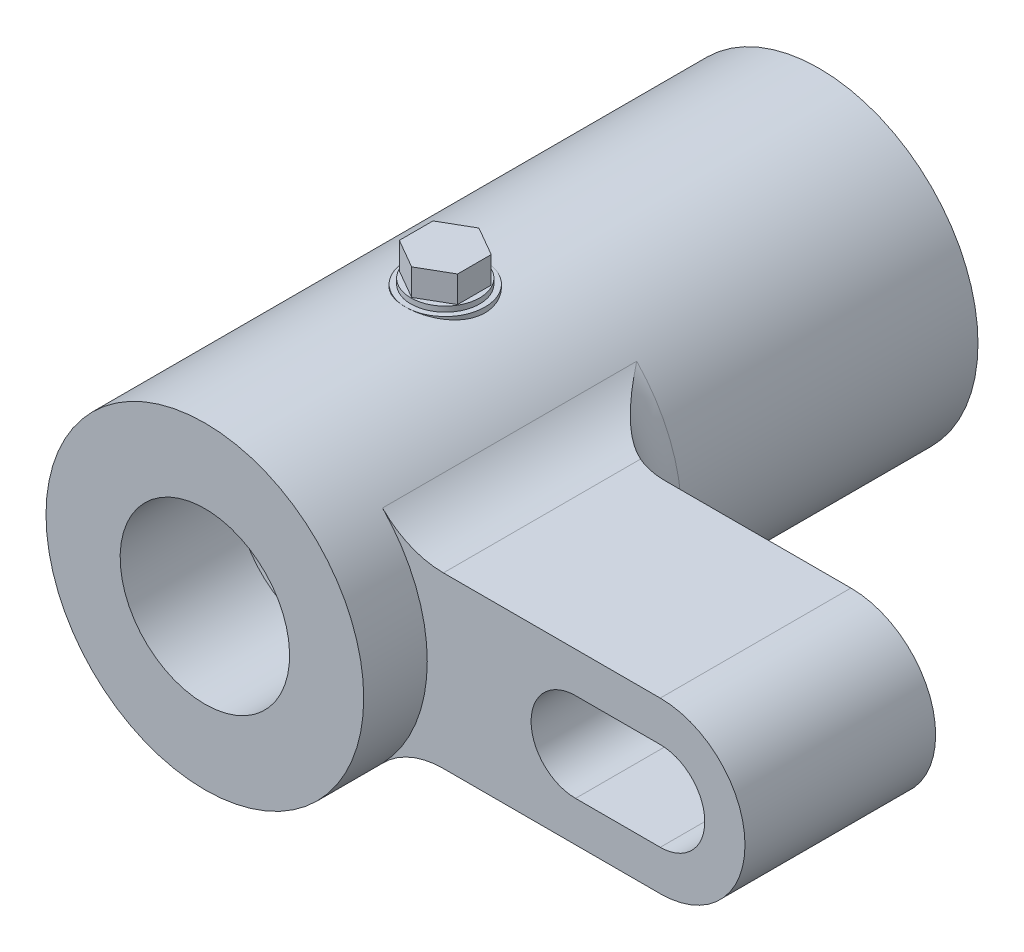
ISO-10303-21;
HEADER;
FILE_DESCRIPTION(('STEP AP214'),'2;1');
FILE_NAME('part.step','',(''),(''),'','','');
FILE_SCHEMA(('AUTOMOTIVE_DESIGN { 1 0 10303 214 1 1 1 1 }'));
ENDSEC;
DATA;
#1=APPLICATION_CONTEXT('core data for automotive mechanical design processes');
#2=APPLICATION_PROTOCOL_DEFINITION('international standard','automotive_design',2000,#1);
#3=PRODUCT_CONTEXT('',#1,'mechanical');
#4=PRODUCT('Part','Part','',(#3));
#5=PRODUCT_RELATED_PRODUCT_CATEGORY('part','',(#4));
#6=PRODUCT_DEFINITION_FORMATION('','',#4);
#7=PRODUCT_DEFINITION_CONTEXT('part definition',#1,'design');
#8=PRODUCT_DEFINITION('design','',#6,#7);
#9=PRODUCT_DEFINITION_SHAPE('','',#8);
#10=(LENGTH_UNIT() NAMED_UNIT(*) SI_UNIT(.MILLI.,.METRE.));
#11=(NAMED_UNIT(*) PLANE_ANGLE_UNIT() SI_UNIT($,.RADIAN.));
#12=(NAMED_UNIT(*) SI_UNIT($,.STERADIAN.) SOLID_ANGLE_UNIT());
#13=UNCERTAINTY_MEASURE_WITH_UNIT(LENGTH_MEASURE(1.E-05),#10,'distance_accuracy_value','');
#14=(GEOMETRIC_REPRESENTATION_CONTEXT(3) GLOBAL_UNCERTAINTY_ASSIGNED_CONTEXT((#13)) GLOBAL_UNIT_ASSIGNED_CONTEXT((#10,
#11,#12)) REPRESENTATION_CONTEXT('',''));
#15=CARTESIAN_POINT('',(0.,0.,0.));
#16=DIRECTION('',(0.,0.,1.));
#17=DIRECTION('',(1.,0.,0.));
#18=AXIS2_PLACEMENT_3D('',#15,#16,#17);
#19=CARTESIAN_POINT('',(0.,15.5,-22.7));
#20=DIRECTION('',(0.,1.,0.));
#21=DIRECTION('',(0.,0.,1.));
#22=AXIS2_PLACEMENT_3D('',#19,#20,#21);
#23=PLANE('',#22);
#24=CARTESIAN_POINT('',(0.,15.5,-22.7));
#25=DIRECTION('',(0.,1.,0.));
#26=DIRECTION('',(0.,0.,1.));
#27=AXIS2_PLACEMENT_3D('',#24,#25,#26);
#28=CIRCLE('',#27,3.25);
#29=CARTESIAN_POINT('',(0.,15.5,-19.45));
#30=VERTEX_POINT('',#29);
#31=EDGE_CURVE('E182',#30,#30,#28,.T.);
#32=ORIENTED_EDGE('',*,*,#31,.T.);
#33=EDGE_LOOP('',(#32));
#34=FACE_BOUND('',#33,.T.);
#35=DIRECTION('',(0.866025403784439,0.,-0.5));
#36=VECTOR('',#35,1.);
#37=CARTESIAN_POINT('',(0.,15.5,-19.524573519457));
#38=LINE('',#37,#36);
#39=CARTESIAN_POINT('',(0.,15.5,-19.524573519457));
#40=VERTEX_POINT('',#39);
#41=CARTESIAN_POINT('',(2.75,15.5,-21.1122867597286));
#42=VERTEX_POINT('',#41);
#43=EDGE_CURVE('E786',#40,#42,#38,.T.);
#44=ORIENTED_EDGE('',*,*,#43,.F.);
#45=DIRECTION('',(0.866025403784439,0.,0.5));
#46=VECTOR('',#45,1.);
#47=CARTESIAN_POINT('',(-2.75,15.5,-21.1122867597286));
#48=LINE('',#47,#46);
#49=CARTESIAN_POINT('',(-2.75,15.5,-21.1122867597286));
#50=VERTEX_POINT('',#49);
#51=EDGE_CURVE('E173',#50,#40,#48,.T.);
#52=ORIENTED_EDGE('',*,*,#51,.F.);
#53=DIRECTION('',(0.,0.,1.));
#54=VECTOR('',#53,1.);
#55=CARTESIAN_POINT('',(-2.75,15.5,-24.2877132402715));
#56=LINE('',#55,#54);
#57=CARTESIAN_POINT('',(-2.75,15.5,-24.2877132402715));
#58=VERTEX_POINT('',#57);
#59=EDGE_CURVE('E169',#58,#50,#56,.T.);
#60=ORIENTED_EDGE('',*,*,#59,.F.);
#61=DIRECTION('',(-0.866025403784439,0.,0.5));
#62=VECTOR('',#61,1.);
#63=CARTESIAN_POINT('',(0.,15.5,-25.8754264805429));
#64=LINE('',#63,#62);
#65=CARTESIAN_POINT('',(0.,15.5,-25.8754264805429));
#66=VERTEX_POINT('',#65);
#67=EDGE_CURVE('E781',#66,#58,#64,.T.);
#68=ORIENTED_EDGE('',*,*,#67,.F.);
#69=DIRECTION('',(-0.866025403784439,0.,-0.5));
#70=VECTOR('',#69,1.);
#71=CARTESIAN_POINT('',(2.75,15.5,-24.2877132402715));
#72=LINE('',#71,#70);
#73=CARTESIAN_POINT('',(2.75,15.5,-24.2877132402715));
#74=VERTEX_POINT('',#73);
#75=EDGE_CURVE('E797',#74,#66,#72,.T.);
#76=ORIENTED_EDGE('',*,*,#75,.F.);
#77=DIRECTION('',(0.,0.,-1.));
#78=VECTOR('',#77,1.);
#79=CARTESIAN_POINT('',(2.75,15.5,-21.1122867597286));
#80=LINE('',#79,#78);
#81=EDGE_CURVE('E790',#42,#74,#80,.T.);
#82=ORIENTED_EDGE('',*,*,#81,.F.);
#83=EDGE_LOOP('',(#44,#52,#60,#68,#76,#82));
#84=FACE_BOUND('',#83,.T.);
#85=ADVANCED_FACE('F15',(#34,#84),#23,.T.);
#86=CARTESIAN_POINT('',(0.,0.,-58.));
#87=DIRECTION('',(0.,0.,-1.));
#88=DIRECTION('',(0.,-1.,0.));
#89=AXIS2_PLACEMENT_3D('',#86,#87,#88);
#90=CYLINDRICAL_SURFACE('',#89,15.);
#91=CARTESIAN_POINT('',(0.,-14.9999999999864,-26.45));
#92=CARTESIAN_POINT('',(-0.20719022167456,-14.9999964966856,-26.4499941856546));
#93=CARTESIAN_POINT('',(-0.414445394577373,-14.9956644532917,-26.4327711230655));
#94=CARTESIAN_POINT('',(-0.823015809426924,-14.9788028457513,-26.3644371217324));
#95=CARTESIAN_POINT('',(-1.02432761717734,-14.9662686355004,-26.3133069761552));
#96=CARTESIAN_POINT('',(-1.41505218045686,-14.9343906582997,-26.1789018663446));
#97=CARTESIAN_POINT('',(-1.60447890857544,-14.9150550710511,-26.0956655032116));
#98=CARTESIAN_POINT('',(-1.96668032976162,-14.8716335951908,-25.8995465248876));
#99=CARTESIAN_POINT('',(-2.13945446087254,-14.8475475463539,-25.7866629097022));
#100=CARTESIAN_POINT('',(-2.46700481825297,-14.7966853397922,-25.531998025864));
#101=CARTESIAN_POINT('',(-2.6213892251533,-14.769867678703,-25.3897210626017));
#102=CARTESIAN_POINT('',(-2.90437231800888,-14.7168405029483,-25.0813694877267));
#103=CARTESIAN_POINT('',(-3.03296809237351,-14.6906310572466,-24.9152921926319));
#104=CARTESIAN_POINT('',(-3.26256635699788,-14.6413693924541,-24.5610119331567));
#105=CARTESIAN_POINT('',(-3.36313053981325,-14.6183698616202,-24.3725169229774));
#106=CARTESIAN_POINT('',(-3.53099227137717,-14.5787373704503,-23.9806289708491));
#107=CARTESIAN_POINT('',(-3.59829513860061,-14.5621033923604,-23.7772384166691));
#108=CARTESIAN_POINT('',(-3.69638709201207,-14.537511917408,-23.3656412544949));
#109=CARTESIAN_POINT('',(-3.72788067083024,-14.5293872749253,-23.1576127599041));
#110=CARTESIAN_POINT('',(-3.75565443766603,-14.5222340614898,-22.7390785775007));
#111=CARTESIAN_POINT('',(-3.75194035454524,-14.5232040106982,-22.5285732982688));
#112=CARTESIAN_POINT('',(-3.70996631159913,-14.5339801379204,-22.1164604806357));
#113=CARTESIAN_POINT('',(-3.6725458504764,-14.5435715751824,-21.9147609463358));
#114=CARTESIAN_POINT('',(-3.56556046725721,-14.5701677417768,-21.5205973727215));
#115=CARTESIAN_POINT('',(-3.49599325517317,-14.587172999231,-21.3281339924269));
#116=CARTESIAN_POINT('',(-3.32597369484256,-14.6268778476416,-20.9556549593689));
#117=CARTESIAN_POINT('',(-3.22521666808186,-14.6496331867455,-20.7757845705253));
#118=CARTESIAN_POINT('',(-2.99589069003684,-14.6982427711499,-20.4352032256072));
#119=CARTESIAN_POINT('',(-2.86731687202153,-14.7240975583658,-20.2744956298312));
#120=CARTESIAN_POINT('',(-2.58165856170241,-14.7768970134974,-19.9719909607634));
#121=CARTESIAN_POINT('',(-2.42386564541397,-14.8038517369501,-19.8308637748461));
#122=CARTESIAN_POINT('',(-2.0865297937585,-14.855149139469,-19.5769468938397));
#123=CARTESIAN_POINT('',(-1.90698619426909,-14.8794917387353,-19.4641580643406));
#124=CARTESIAN_POINT('',(-1.53028972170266,-14.9229433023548,-19.2698735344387));
#125=CARTESIAN_POINT('',(-1.33307848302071,-14.9420340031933,-19.1884866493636));
#126=CARTESIAN_POINT('',(-0.927190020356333,-14.9726979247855,-19.0602067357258));
#127=CARTESIAN_POINT('',(-0.718514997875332,-14.9842725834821,-19.0133071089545));
#128=CARTESIAN_POINT('',(-0.301349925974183,-14.9983874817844,-18.9563560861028));
#129=CARTESIAN_POINT('',(-0.0929917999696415,-15.0011513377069,-18.9453924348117));
#130=CARTESIAN_POINT('',(0.322582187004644,-14.9979701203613,-18.9581225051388));
#131=CARTESIAN_POINT('',(0.529798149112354,-14.9920258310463,-18.9818131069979));
#132=CARTESIAN_POINT('',(0.934035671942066,-14.9722395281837,-19.0624272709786));
#133=CARTESIAN_POINT('',(1.1311627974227,-14.9585158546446,-19.1188531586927));
#134=CARTESIAN_POINT('',(1.51314323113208,-14.9247176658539,-19.2627677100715));
#135=CARTESIAN_POINT('',(1.6979952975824,-14.9046425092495,-19.3502595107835));
#136=CARTESIAN_POINT('',(2.0538078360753,-14.8598326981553,-19.5555903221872));
#137=CARTESIAN_POINT('',(2.22446360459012,-14.8350216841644,-19.6739402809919));
#138=CARTESIAN_POINT('',(2.54381653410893,-14.7836127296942,-19.9369747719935));
#139=CARTESIAN_POINT('',(2.69250989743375,-14.7570144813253,-20.0816638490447));
#140=CARTESIAN_POINT('',(2.96747642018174,-14.7042239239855,-20.39750490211));
#141=CARTESIAN_POINT('',(3.09310966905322,-14.6780576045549,-20.5692192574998));
#142=CARTESIAN_POINT('',(3.31377689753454,-14.6298219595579,-20.9318315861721));
#143=CARTESIAN_POINT('',(3.40881223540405,-14.6077524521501,-21.1227287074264));
#144=CARTESIAN_POINT('',(3.56487855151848,-14.570452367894,-21.517264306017));
#145=CARTESIAN_POINT('',(3.62611099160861,-14.5551813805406,-21.7208190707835));
#146=CARTESIAN_POINT('',(3.71336414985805,-14.5331686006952,-22.1357740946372));
#147=CARTESIAN_POINT('',(3.73939256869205,-14.5264249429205,-22.3471726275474));
#148=CARTESIAN_POINT('',(3.75509647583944,-14.5223725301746,-22.7653025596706));
#149=CARTESIAN_POINT('',(3.7457947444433,-14.5247983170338,-22.9719935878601));
#150=CARTESIAN_POINT('',(3.69344319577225,-14.5381977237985,-23.3807597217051));
#151=CARTESIAN_POINT('',(3.65039405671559,-14.5491711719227,-23.5828349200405));
#152=CARTESIAN_POINT('',(3.53232829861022,-14.5782815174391,-23.9755211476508));
#153=CARTESIAN_POINT('',(3.45750351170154,-14.5963753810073,-24.1661932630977));
#154=CARTESIAN_POINT('',(3.2781622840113,-14.6376938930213,-24.5324134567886));
#155=CARTESIAN_POINT('',(3.17364172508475,-14.6609192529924,-24.707959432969));
#156=CARTESIAN_POINT('',(2.93466937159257,-14.7106408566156,-25.0438865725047));
#157=CARTESIAN_POINT('',(2.79950790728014,-14.7372066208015,-25.2037526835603));
#158=CARTESIAN_POINT('',(2.50447342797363,-14.7902006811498,-25.4988676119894));
#159=CARTESIAN_POINT('',(2.34459455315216,-14.8166289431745,-25.6341105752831));
#160=CARTESIAN_POINT('',(2.0011689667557,-14.8669413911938,-25.878528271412));
#161=CARTESIAN_POINT('',(1.81724605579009,-14.8907708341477,-25.9871865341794));
#162=CARTESIAN_POINT('',(1.43316514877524,-14.9326231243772,-26.1718686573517));
#163=CARTESIAN_POINT('',(1.23301890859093,-14.9506501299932,-26.2479159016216));
#164=CARTESIAN_POINT('',(0.861025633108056,-14.9762014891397,-26.3539295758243));
#165=CARTESIAN_POINT('',(0.690950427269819,-14.9850646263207,-26.3898781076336));
#166=CARTESIAN_POINT('',(0.347265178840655,-14.9969651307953,-26.4379148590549));
#167=CARTESIAN_POINT('',(0.173655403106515,-15.0000029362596,-26.4500048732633));
#168=CARTESIAN_POINT('',(0.,-14.9999999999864,-26.45));
#169=B_SPLINE_CURVE_WITH_KNOTS('',3,(#91,#92,#93,#94,#95,#96,#97,#98,#99,#100,#101,#102,#103,
#104,#105,#106,#107,#108,#109,#110,#111,#112,#113,#114,#115,#116,#117,#118,#119,#120,#121,#122,
#123,#124,#125,#126,#127,#128,#129,#130,#131,#132,#133,#134,#135,#136,#137,#138,#139,#140,#141,
#142,#143,#144,#145,#146,#147,#148,#149,#150,#151,#152,#153,#154,#155,#156,#157,#158,#159,#160,
#161,#162,#163,#164,#165,#166,#167,#168),.UNSPECIFIED.,.T.,.F.,(4,2,2,2,2,2,2,2,2,2,2,2,2,2,2,2,
2,2,2,2,2,2,2,2,2,2,2,2,2,2,2,2,2,2,2,2,2,2,4),(0.,0.620934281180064,1.24222059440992,
1.86276225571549,2.4833248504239,3.11536088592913,3.74746823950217,4.38896618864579,
5.03036152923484,5.65890737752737,6.28735095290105,6.90056242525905,7.51381758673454,
8.13326319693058,8.75281727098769,9.39003752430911,10.0272772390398,10.6667057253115,
11.3060118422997,11.9289577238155,12.5518475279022,13.1655068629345,13.7792281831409,
14.4038396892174,15.0285590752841,15.6686127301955,16.3086379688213,16.9448063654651,
17.5808355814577,18.1985945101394,18.8163410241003,19.4304100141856,20.044564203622,
20.6747394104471,21.3050642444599,21.9468046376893,22.5880840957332,23.1085560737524,
23.6289889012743),.UNSPECIFIED.);
#170=CARTESIAN_POINT('',(0.,-15.,-26.45));
#171=VERTEX_POINT('',#170);
#172=CARTESIAN_POINT('',(0.,-15.,-18.95));
#173=VERTEX_POINT('',#172);
#174=EDGE_CURVE('E736',#171,#173,#169,.T.);
#175=ORIENTED_EDGE('',*,*,#174,.T.);
#176=CARTESIAN_POINT('',(0.,-14.9999999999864,-26.45));
#177=CARTESIAN_POINT('',(-0.20719022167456,-14.9999964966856,-26.4499941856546));
#178=CARTESIAN_POINT('',(-0.414445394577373,-14.9956644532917,-26.4327711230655));
#179=CARTESIAN_POINT('',(-0.823015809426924,-14.9788028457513,-26.3644371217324));
#180=CARTESIAN_POINT('',(-1.02432761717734,-14.9662686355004,-26.3133069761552));
#181=CARTESIAN_POINT('',(-1.41505218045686,-14.9343906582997,-26.1789018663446));
#182=CARTESIAN_POINT('',(-1.60447890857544,-14.9150550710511,-26.0956655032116));
#183=CARTESIAN_POINT('',(-1.96668032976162,-14.8716335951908,-25.8995465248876));
#184=CARTESIAN_POINT('',(-2.13945446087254,-14.8475475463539,-25.7866629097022));
#185=CARTESIAN_POINT('',(-2.46700481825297,-14.7966853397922,-25.531998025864));
#186=CARTESIAN_POINT('',(-2.6213892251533,-14.769867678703,-25.3897210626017));
#187=CARTESIAN_POINT('',(-2.90437231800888,-14.7168405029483,-25.0813694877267));
#188=CARTESIAN_POINT('',(-3.03296809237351,-14.6906310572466,-24.9152921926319));
#189=CARTESIAN_POINT('',(-3.26256635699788,-14.6413693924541,-24.5610119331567));
#190=CARTESIAN_POINT('',(-3.36313053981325,-14.6183698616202,-24.3725169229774));
#191=CARTESIAN_POINT('',(-3.53099227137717,-14.5787373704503,-23.9806289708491));
#192=CARTESIAN_POINT('',(-3.59829513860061,-14.5621033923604,-23.7772384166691));
#193=CARTESIAN_POINT('',(-3.69638709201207,-14.537511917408,-23.3656412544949));
#194=CARTESIAN_POINT('',(-3.72788067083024,-14.5293872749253,-23.1576127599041));
#195=CARTESIAN_POINT('',(-3.75565443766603,-14.5222340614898,-22.7390785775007));
#196=CARTESIAN_POINT('',(-3.75194035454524,-14.5232040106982,-22.5285732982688));
#197=CARTESIAN_POINT('',(-3.70996631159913,-14.5339801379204,-22.1164604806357));
#198=CARTESIAN_POINT('',(-3.6725458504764,-14.5435715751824,-21.9147609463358));
#199=CARTESIAN_POINT('',(-3.56556046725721,-14.5701677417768,-21.5205973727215));
#200=CARTESIAN_POINT('',(-3.49599325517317,-14.587172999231,-21.3281339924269));
#201=CARTESIAN_POINT('',(-3.32597369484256,-14.6268778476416,-20.9556549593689));
#202=CARTESIAN_POINT('',(-3.22521666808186,-14.6496331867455,-20.7757845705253));
#203=CARTESIAN_POINT('',(-2.99589069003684,-14.6982427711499,-20.4352032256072));
#204=CARTESIAN_POINT('',(-2.86731687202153,-14.7240975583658,-20.2744956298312));
#205=CARTESIAN_POINT('',(-2.58165856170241,-14.7768970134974,-19.9719909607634));
#206=CARTESIAN_POINT('',(-2.42386564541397,-14.8038517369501,-19.8308637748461));
#207=CARTESIAN_POINT('',(-2.0865297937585,-14.855149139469,-19.5769468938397));
#208=CARTESIAN_POINT('',(-1.90698619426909,-14.8794917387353,-19.4641580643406));
#209=CARTESIAN_POINT('',(-1.53028972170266,-14.9229433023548,-19.2698735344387));
#210=CARTESIAN_POINT('',(-1.33307848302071,-14.9420340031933,-19.1884866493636));
#211=CARTESIAN_POINT('',(-0.927190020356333,-14.9726979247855,-19.0602067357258));
#212=CARTESIAN_POINT('',(-0.718514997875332,-14.9842725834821,-19.0133071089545));
#213=CARTESIAN_POINT('',(-0.301349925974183,-14.9983874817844,-18.9563560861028));
#214=CARTESIAN_POINT('',(-0.0929917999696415,-15.0011513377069,-18.9453924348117));
#215=CARTESIAN_POINT('',(0.322582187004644,-14.9979701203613,-18.9581225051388));
#216=CARTESIAN_POINT('',(0.529798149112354,-14.9920258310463,-18.9818131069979));
#217=CARTESIAN_POINT('',(0.934035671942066,-14.9722395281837,-19.0624272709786));
#218=CARTESIAN_POINT('',(1.1311627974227,-14.9585158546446,-19.1188531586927));
#219=CARTESIAN_POINT('',(1.51314323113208,-14.9247176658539,-19.2627677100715));
#220=CARTESIAN_POINT('',(1.6979952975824,-14.9046425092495,-19.3502595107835));
#221=CARTESIAN_POINT('',(2.0538078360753,-14.8598326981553,-19.5555903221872));
#222=CARTESIAN_POINT('',(2.22446360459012,-14.8350216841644,-19.6739402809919));
#223=CARTESIAN_POINT('',(2.54381653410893,-14.7836127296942,-19.9369747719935));
#224=CARTESIAN_POINT('',(2.69250989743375,-14.7570144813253,-20.0816638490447));
#225=CARTESIAN_POINT('',(2.96747642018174,-14.7042239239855,-20.39750490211));
#226=CARTESIAN_POINT('',(3.09310966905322,-14.6780576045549,-20.5692192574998));
#227=CARTESIAN_POINT('',(3.31377689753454,-14.6298219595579,-20.9318315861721));
#228=CARTESIAN_POINT('',(3.40881223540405,-14.6077524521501,-21.1227287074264));
#229=CARTESIAN_POINT('',(3.56487855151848,-14.570452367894,-21.517264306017));
#230=CARTESIAN_POINT('',(3.62611099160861,-14.5551813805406,-21.7208190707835));
#231=CARTESIAN_POINT('',(3.71336414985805,-14.5331686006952,-22.1357740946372));
#232=CARTESIAN_POINT('',(3.73939256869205,-14.5264249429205,-22.3471726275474));
#233=CARTESIAN_POINT('',(3.75509647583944,-14.5223725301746,-22.7653025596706));
#234=CARTESIAN_POINT('',(3.7457947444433,-14.5247983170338,-22.9719935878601));
#235=CARTESIAN_POINT('',(3.69344319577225,-14.5381977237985,-23.3807597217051));
#236=CARTESIAN_POINT('',(3.65039405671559,-14.5491711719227,-23.5828349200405));
#237=CARTESIAN_POINT('',(3.53232829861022,-14.5782815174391,-23.9755211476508));
#238=CARTESIAN_POINT('',(3.45750351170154,-14.5963753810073,-24.1661932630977));
#239=CARTESIAN_POINT('',(3.2781622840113,-14.6376938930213,-24.5324134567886));
#240=CARTESIAN_POINT('',(3.17364172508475,-14.6609192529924,-24.707959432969));
#241=CARTESIAN_POINT('',(2.93466937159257,-14.7106408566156,-25.0438865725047));
#242=CARTESIAN_POINT('',(2.79950790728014,-14.7372066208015,-25.2037526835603));
#243=CARTESIAN_POINT('',(2.50447342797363,-14.7902006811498,-25.4988676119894));
#244=CARTESIAN_POINT('',(2.34459455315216,-14.8166289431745,-25.6341105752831));
#245=CARTESIAN_POINT('',(2.0011689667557,-14.8669413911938,-25.878528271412));
#246=CARTESIAN_POINT('',(1.81724605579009,-14.8907708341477,-25.9871865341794));
#247=CARTESIAN_POINT('',(1.43316514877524,-14.9326231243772,-26.1718686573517));
#248=CARTESIAN_POINT('',(1.23301890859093,-14.9506501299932,-26.2479159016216));
#249=CARTESIAN_POINT('',(0.861025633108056,-14.9762014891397,-26.3539295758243));
#250=CARTESIAN_POINT('',(0.690950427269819,-14.9850646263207,-26.3898781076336));
#251=CARTESIAN_POINT('',(0.347265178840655,-14.9969651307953,-26.4379148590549));
#252=CARTESIAN_POINT('',(0.173655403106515,-15.0000029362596,-26.4500048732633));
#253=CARTESIAN_POINT('',(0.,-14.9999999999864,-26.45));
#254=B_SPLINE_CURVE_WITH_KNOTS('',3,(#176,#177,#178,#179,#180,#181,#182,#183,#184,#185,#186,
#187,#188,#189,#190,#191,#192,#193,#194,#195,#196,#197,#198,#199,#200,#201,#202,#203,#204,#205,
#206,#207,#208,#209,#210,#211,#212,#213,#214,#215,#216,#217,#218,#219,#220,#221,#222,#223,#224,
#225,#226,#227,#228,#229,#230,#231,#232,#233,#234,#235,#236,#237,#238,#239,#240,#241,#242,#243,
#244,#245,#246,#247,#248,#249,#250,#251,#252,#253),.UNSPECIFIED.,.T.,.F.,(4,2,2,2,2,2,2,2,2,2,2,
2,2,2,2,2,2,2,2,2,2,2,2,2,2,2,2,2,2,2,2,2,2,2,2,2,2,2,4),(0.,0.620934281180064,1.24222059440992,
1.86276225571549,2.4833248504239,3.11536088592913,3.74746823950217,4.38896618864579,
5.03036152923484,5.65890737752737,6.28735095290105,6.90056242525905,7.51381758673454,
8.13326319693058,8.75281727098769,9.39003752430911,10.0272772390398,10.6667057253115,
11.3060118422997,11.9289577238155,12.5518475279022,13.1655068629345,13.7792281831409,
14.4038396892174,15.0285590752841,15.6686127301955,16.3086379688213,16.9448063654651,
17.5808355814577,18.1985945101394,18.8163410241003,19.4304100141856,20.044564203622,
20.6747394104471,21.3050642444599,21.9468046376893,22.5880840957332,23.1085560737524,
23.6289889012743),.UNSPECIFIED.);
#255=EDGE_CURVE('E565',#173,#171,#254,.T.);
#256=ORIENTED_EDGE('',*,*,#255,.T.);
#257=EDGE_LOOP('',(#175,#256));
#258=FACE_BOUND('',#257,.T.);
#259=CARTESIAN_POINT('',(0.,0.,0.));
#260=DIRECTION('',(0.,0.,1.));
#261=DIRECTION('',(1.,0.,0.));
#262=AXIS2_PLACEMENT_3D('',#259,#260,#261);
#263=CIRCLE('',#262,15.);
#264=CARTESIAN_POINT('',(15.,0.,0.));
#265=VERTEX_POINT('',#264);
#266=EDGE_CURVE('E576',#265,#265,#263,.T.);
#267=ORIENTED_EDGE('',*,*,#266,.F.);
#268=EDGE_LOOP('',(#267));
#269=FACE_BOUND('',#268,.T.);
#270=DIRECTION('',(0.,0.,-1.));
#271=VECTOR('',#270,1.);
#272=CARTESIAN_POINT('',(10.7756815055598,-10.4347826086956,-58.));
#273=LINE('',#272,#271);
#274=CARTESIAN_POINT('',(10.7756815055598,-10.4347826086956,-30.));
#275=VERTEX_POINT('',#274);
#276=CARTESIAN_POINT('',(10.7756815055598,-10.4347826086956,-6.));
#277=VERTEX_POINT('',#276);
#278=EDGE_CURVE('E660',#275,#277,#273,.F.);
#279=ORIENTED_EDGE('',*,*,#278,.T.);
#280=CARTESIAN_POINT('',(0.,0.,-6.));
#281=DIRECTION('',(0.,0.,1.));
#282=DIRECTION('',(1.,0.,0.));
#283=AXIS2_PLACEMENT_3D('',#280,#281,#282);
#284=CIRCLE('',#283,15.);
#285=CARTESIAN_POINT('',(10.7756815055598,10.4347826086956,-6.));
#286=VERTEX_POINT('',#285);
#287=EDGE_CURVE('E573',#277,#286,#284,.T.);
#288=ORIENTED_EDGE('',*,*,#287,.T.);
#289=DIRECTION('',(0.,0.,-1.));
#290=VECTOR('',#289,1.);
#291=CARTESIAN_POINT('',(10.7756815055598,10.4347826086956,-58.));
#292=LINE('',#291,#290);
#293=CARTESIAN_POINT('',(10.7756815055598,10.4347826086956,-30.));
#294=VERTEX_POINT('',#293);
#295=EDGE_CURVE('E657',#286,#294,#292,.T.);
#296=ORIENTED_EDGE('',*,*,#295,.T.);
#297=CARTESIAN_POINT('',(0.,0.,-30.));
#298=DIRECTION('',(0.,0.,-1.));
#299=DIRECTION('',(0.,-1.,0.));
#300=AXIS2_PLACEMENT_3D('',#297,#298,#299);
#301=CIRCLE('',#300,15.);
#302=EDGE_CURVE('E677',#294,#275,#301,.T.);
#303=ORIENTED_EDGE('',*,*,#302,.T.);
#304=EDGE_LOOP('',(#279,#288,#296,#303));
#305=FACE_BOUND('',#304,.T.);
#306=CARTESIAN_POINT('',(0.,0.,-58.));
#307=DIRECTION('',(0.,0.,-1.));
#308=DIRECTION('',(0.,-1.,0.));
#309=AXIS2_PLACEMENT_3D('',#306,#307,#308);
#310=CIRCLE('',#309,15.);
#311=CARTESIAN_POINT('',(0.,-15.,-58.));
#312=VERTEX_POINT('',#311);
#313=EDGE_CURVE('E649',#312,#312,#310,.T.);
#314=ORIENTED_EDGE('',*,*,#313,.F.);
#315=EDGE_LOOP('',(#314));
#316=FACE_BOUND('',#315,.T.);
#317=CARTESIAN_POINT('',(0.,14.9999999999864,-18.95));
#318=CARTESIAN_POINT('',(0.20719022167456,14.9999964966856,-18.9500058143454));
#319=CARTESIAN_POINT('',(0.414445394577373,14.9956644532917,-18.9672288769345));
#320=CARTESIAN_POINT('',(0.823015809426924,14.9788028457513,-19.0355628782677));
#321=CARTESIAN_POINT('',(1.02432761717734,14.9662686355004,-19.0866930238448));
#322=CARTESIAN_POINT('',(1.41505218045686,14.9343906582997,-19.2210981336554));
#323=CARTESIAN_POINT('',(1.60447890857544,14.9150550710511,-19.3043344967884));
#324=CARTESIAN_POINT('',(1.96668032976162,14.8716335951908,-19.5004534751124));
#325=CARTESIAN_POINT('',(2.13945446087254,14.8475475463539,-19.6133370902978));
#326=CARTESIAN_POINT('',(2.46700481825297,14.7966853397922,-19.868001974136));
#327=CARTESIAN_POINT('',(2.6213892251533,14.769867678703,-20.0102789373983));
#328=CARTESIAN_POINT('',(2.90437231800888,14.7168405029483,-20.3186305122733));
#329=CARTESIAN_POINT('',(3.03296809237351,14.6906310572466,-20.4847078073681));
#330=CARTESIAN_POINT('',(3.26256635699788,14.6413693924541,-20.8389880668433));
#331=CARTESIAN_POINT('',(3.36313053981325,14.6183698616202,-21.0274830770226));
#332=CARTESIAN_POINT('',(3.53099227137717,14.5787373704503,-21.4193710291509));
#333=CARTESIAN_POINT('',(3.59829513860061,14.5621033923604,-21.6227615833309));
#334=CARTESIAN_POINT('',(3.69638709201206,14.537511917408,-22.034358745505));
#335=CARTESIAN_POINT('',(3.72788067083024,14.5293872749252,-22.2423872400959));
#336=CARTESIAN_POINT('',(3.75565443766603,14.5222340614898,-22.6609214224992));
#337=CARTESIAN_POINT('',(3.75194035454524,14.5232040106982,-22.8714267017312));
#338=CARTESIAN_POINT('',(3.70996631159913,14.5339801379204,-23.2835395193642));
#339=CARTESIAN_POINT('',(3.67254585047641,14.5435715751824,-23.4852390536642));
#340=CARTESIAN_POINT('',(3.56556046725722,14.5701677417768,-23.8794026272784));
#341=CARTESIAN_POINT('',(3.49599325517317,14.587172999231,-24.0718660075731));
#342=CARTESIAN_POINT('',(3.32597369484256,14.6268778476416,-24.4443450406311));
#343=CARTESIAN_POINT('',(3.22521666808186,14.6496331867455,-24.6242154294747));
#344=CARTESIAN_POINT('',(2.99589069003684,14.6982427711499,-24.9647967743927));
#345=CARTESIAN_POINT('',(2.86731687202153,14.7240975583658,-25.1255043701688));
#346=CARTESIAN_POINT('',(2.58165856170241,14.7768970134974,-25.4280090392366));
#347=CARTESIAN_POINT('',(2.42386564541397,14.8038517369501,-25.569136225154));
#348=CARTESIAN_POINT('',(2.0865297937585,14.855149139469,-25.8230531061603));
#349=CARTESIAN_POINT('',(1.90698619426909,14.8794917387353,-25.9358419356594));
#350=CARTESIAN_POINT('',(1.53028972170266,14.9229433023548,-26.1301264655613));
#351=CARTESIAN_POINT('',(1.33307848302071,14.9420340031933,-26.2115133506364));
#352=CARTESIAN_POINT('',(0.927190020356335,14.9726979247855,-26.3397932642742));
#353=CARTESIAN_POINT('',(0.718514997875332,14.9842725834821,-26.3866928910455));
#354=CARTESIAN_POINT('',(0.301349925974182,14.9983874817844,-26.4436439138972));
#355=CARTESIAN_POINT('',(0.0929917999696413,15.0011513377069,-26.4546075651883));
#356=CARTESIAN_POINT('',(-0.322582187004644,14.9979701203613,-26.4418774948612));
#357=CARTESIAN_POINT('',(-0.529798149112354,14.9920258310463,-26.4181868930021));
#358=CARTESIAN_POINT('',(-0.934035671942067,14.9722395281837,-26.3375727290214));
#359=CARTESIAN_POINT('',(-1.1311627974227,14.9585158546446,-26.2811468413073));
#360=CARTESIAN_POINT('',(-1.51314323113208,14.9247176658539,-26.1372322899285));
#361=CARTESIAN_POINT('',(-1.6979952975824,14.9046425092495,-26.0497404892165));
#362=CARTESIAN_POINT('',(-2.0538078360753,14.8598326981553,-25.8444096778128));
#363=CARTESIAN_POINT('',(-2.22446360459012,14.8350216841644,-25.7260597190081));
#364=CARTESIAN_POINT('',(-2.54381653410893,14.7836127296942,-25.4630252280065));
#365=CARTESIAN_POINT('',(-2.69250989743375,14.7570144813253,-25.3183361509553));
#366=CARTESIAN_POINT('',(-2.96747642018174,14.7042239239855,-25.00249509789));
#367=CARTESIAN_POINT('',(-3.09310966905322,14.6780576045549,-24.8307807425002));
#368=CARTESIAN_POINT('',(-3.31377689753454,14.6298219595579,-24.4681684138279));
#369=CARTESIAN_POINT('',(-3.40881223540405,14.6077524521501,-24.2772712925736));
#370=CARTESIAN_POINT('',(-3.56487855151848,14.570452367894,-23.882735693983));
#371=CARTESIAN_POINT('',(-3.62611099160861,14.5551813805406,-23.6791809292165));
#372=CARTESIAN_POINT('',(-3.71336414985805,14.5331686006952,-23.2642259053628));
#373=CARTESIAN_POINT('',(-3.73939256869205,14.5264249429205,-23.0528273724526));
#374=CARTESIAN_POINT('',(-3.75509647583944,14.5223725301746,-22.6346974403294));
#375=CARTESIAN_POINT('',(-3.7457947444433,14.5247983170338,-22.4280064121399));
#376=CARTESIAN_POINT('',(-3.69344319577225,14.5381977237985,-22.0192402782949));
#377=CARTESIAN_POINT('',(-3.65039405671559,14.5491711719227,-21.8171650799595));
#378=CARTESIAN_POINT('',(-3.53232829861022,14.5782815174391,-21.4244788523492));
#379=CARTESIAN_POINT('',(-3.45750351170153,14.5963753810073,-21.2338067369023));
#380=CARTESIAN_POINT('',(-3.27816228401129,14.6376938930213,-20.8675865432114));
#381=CARTESIAN_POINT('',(-3.17364172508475,14.6609192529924,-20.692040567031));
#382=CARTESIAN_POINT('',(-2.93466937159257,14.7106408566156,-20.3561134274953));
#383=CARTESIAN_POINT('',(-2.79950790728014,14.7372066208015,-20.1962473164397));
#384=CARTESIAN_POINT('',(-2.50447342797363,14.7902006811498,-19.9011323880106));
#385=CARTESIAN_POINT('',(-2.34459455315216,14.8166289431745,-19.7658894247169));
#386=CARTESIAN_POINT('',(-2.0011689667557,14.8669413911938,-19.521471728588));
#387=CARTESIAN_POINT('',(-1.81724605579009,14.8907708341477,-19.4128134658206));
#388=CARTESIAN_POINT('',(-1.43316514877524,14.9326231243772,-19.2281313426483));
#389=CARTESIAN_POINT('',(-1.23301890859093,14.9506501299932,-19.1520840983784));
#390=CARTESIAN_POINT('',(-0.861025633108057,14.9762014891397,-19.0460704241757));
#391=CARTESIAN_POINT('',(-0.690950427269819,14.9850646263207,-19.0101218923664));
#392=CARTESIAN_POINT('',(-0.347265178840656,14.9969651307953,-18.9620851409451));
#393=CARTESIAN_POINT('',(-0.173655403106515,15.0000029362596,-18.9499951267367));
#394=CARTESIAN_POINT('',(0.,14.9999999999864,-18.95));
#395=B_SPLINE_CURVE_WITH_KNOTS('',3,(#317,#318,#319,#320,#321,#322,#323,#324,#325,#326,#327,
#328,#329,#330,#331,#332,#333,#334,#335,#336,#337,#338,#339,#340,#341,#342,#343,#344,#345,#346,
#347,#348,#349,#350,#351,#352,#353,#354,#355,#356,#357,#358,#359,#360,#361,#362,#363,#364,#365,
#366,#367,#368,#369,#370,#371,#372,#373,#374,#375,#376,#377,#378,#379,#380,#381,#382,#383,#384,
#385,#386,#387,#388,#389,#390,#391,#392,#393,#394),.UNSPECIFIED.,.T.,.F.,(4,2,2,2,2,2,2,2,2,2,2,
2,2,2,2,2,2,2,2,2,2,2,2,2,2,2,2,2,2,2,2,2,2,2,2,2,2,2,4),(0.,0.620934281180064,1.24222059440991,
1.86276225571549,2.4833248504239,3.11536088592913,3.74746823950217,4.38896618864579,
5.03036152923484,5.65890737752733,6.28735095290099,6.90056242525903,7.51381758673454,
8.13326319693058,8.75281727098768,9.39003752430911,10.0272772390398,10.6667057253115,
11.3060118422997,11.9289577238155,12.5518475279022,13.1655068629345,13.7792281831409,
14.4038396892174,15.0285590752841,15.6686127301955,16.3086379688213,16.9448063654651,
17.5808355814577,18.1985945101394,18.8163410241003,19.4304100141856,20.0445642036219,
20.6747394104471,21.3050642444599,21.9468046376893,22.5880840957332,23.1085560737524,
23.6289889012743),.UNSPECIFIED.);
#396=CARTESIAN_POINT('',(0.,15.,-26.45));
#397=VERTEX_POINT('',#396);
#398=CARTESIAN_POINT('',(0.,15.,-18.95));
#399=VERTEX_POINT('',#398);
#400=EDGE_CURVE('E732',#397,#399,#395,.T.);
#401=ORIENTED_EDGE('',*,*,#400,.F.);
#402=CARTESIAN_POINT('',(0.,14.9999999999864,-18.95));
#403=CARTESIAN_POINT('',(0.20719022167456,14.9999964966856,-18.9500058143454));
#404=CARTESIAN_POINT('',(0.414445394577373,14.9956644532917,-18.9672288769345));
#405=CARTESIAN_POINT('',(0.823015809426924,14.9788028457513,-19.0355628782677));
#406=CARTESIAN_POINT('',(1.02432761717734,14.9662686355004,-19.0866930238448));
#407=CARTESIAN_POINT('',(1.41505218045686,14.9343906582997,-19.2210981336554));
#408=CARTESIAN_POINT('',(1.60447890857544,14.9150550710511,-19.3043344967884));
#409=CARTESIAN_POINT('',(1.96668032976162,14.8716335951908,-19.5004534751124));
#410=CARTESIAN_POINT('',(2.13945446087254,14.8475475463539,-19.6133370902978));
#411=CARTESIAN_POINT('',(2.46700481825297,14.7966853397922,-19.868001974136));
#412=CARTESIAN_POINT('',(2.6213892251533,14.769867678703,-20.0102789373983));
#413=CARTESIAN_POINT('',(2.90437231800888,14.7168405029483,-20.3186305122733));
#414=CARTESIAN_POINT('',(3.03296809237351,14.6906310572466,-20.4847078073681));
#415=CARTESIAN_POINT('',(3.26256635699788,14.6413693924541,-20.8389880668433));
#416=CARTESIAN_POINT('',(3.36313053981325,14.6183698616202,-21.0274830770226));
#417=CARTESIAN_POINT('',(3.53099227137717,14.5787373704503,-21.4193710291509));
#418=CARTESIAN_POINT('',(3.59829513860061,14.5621033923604,-21.6227615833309));
#419=CARTESIAN_POINT('',(3.69638709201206,14.537511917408,-22.034358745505));
#420=CARTESIAN_POINT('',(3.72788067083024,14.5293872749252,-22.2423872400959));
#421=CARTESIAN_POINT('',(3.75565443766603,14.5222340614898,-22.6609214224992));
#422=CARTESIAN_POINT('',(3.75194035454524,14.5232040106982,-22.8714267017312));
#423=CARTESIAN_POINT('',(3.70996631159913,14.5339801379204,-23.2835395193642));
#424=CARTESIAN_POINT('',(3.67254585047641,14.5435715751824,-23.4852390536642));
#425=CARTESIAN_POINT('',(3.56556046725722,14.5701677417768,-23.8794026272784));
#426=CARTESIAN_POINT('',(3.49599325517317,14.587172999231,-24.0718660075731));
#427=CARTESIAN_POINT('',(3.32597369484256,14.6268778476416,-24.4443450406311));
#428=CARTESIAN_POINT('',(3.22521666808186,14.6496331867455,-24.6242154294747));
#429=CARTESIAN_POINT('',(2.99589069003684,14.6982427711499,-24.9647967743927));
#430=CARTESIAN_POINT('',(2.86731687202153,14.7240975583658,-25.1255043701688));
#431=CARTESIAN_POINT('',(2.58165856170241,14.7768970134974,-25.4280090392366));
#432=CARTESIAN_POINT('',(2.42386564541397,14.8038517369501,-25.569136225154));
#433=CARTESIAN_POINT('',(2.0865297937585,14.855149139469,-25.8230531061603));
#434=CARTESIAN_POINT('',(1.90698619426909,14.8794917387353,-25.9358419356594));
#435=CARTESIAN_POINT('',(1.53028972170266,14.9229433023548,-26.1301264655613));
#436=CARTESIAN_POINT('',(1.33307848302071,14.9420340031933,-26.2115133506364));
#437=CARTESIAN_POINT('',(0.927190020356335,14.9726979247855,-26.3397932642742));
#438=CARTESIAN_POINT('',(0.718514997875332,14.9842725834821,-26.3866928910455));
#439=CARTESIAN_POINT('',(0.301349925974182,14.9983874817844,-26.4436439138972));
#440=CARTESIAN_POINT('',(0.0929917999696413,15.0011513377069,-26.4546075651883));
#441=CARTESIAN_POINT('',(-0.322582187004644,14.9979701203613,-26.4418774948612));
#442=CARTESIAN_POINT('',(-0.529798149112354,14.9920258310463,-26.4181868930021));
#443=CARTESIAN_POINT('',(-0.934035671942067,14.9722395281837,-26.3375727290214));
#444=CARTESIAN_POINT('',(-1.1311627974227,14.9585158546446,-26.2811468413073));
#445=CARTESIAN_POINT('',(-1.51314323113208,14.9247176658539,-26.1372322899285));
#446=CARTESIAN_POINT('',(-1.6979952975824,14.9046425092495,-26.0497404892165));
#447=CARTESIAN_POINT('',(-2.0538078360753,14.8598326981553,-25.8444096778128));
#448=CARTESIAN_POINT('',(-2.22446360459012,14.8350216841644,-25.7260597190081));
#449=CARTESIAN_POINT('',(-2.54381653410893,14.7836127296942,-25.4630252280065));
#450=CARTESIAN_POINT('',(-2.69250989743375,14.7570144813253,-25.3183361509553));
#451=CARTESIAN_POINT('',(-2.96747642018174,14.7042239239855,-25.00249509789));
#452=CARTESIAN_POINT('',(-3.09310966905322,14.6780576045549,-24.8307807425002));
#453=CARTESIAN_POINT('',(-3.31377689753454,14.6298219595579,-24.4681684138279));
#454=CARTESIAN_POINT('',(-3.40881223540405,14.6077524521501,-24.2772712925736));
#455=CARTESIAN_POINT('',(-3.56487855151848,14.570452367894,-23.882735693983));
#456=CARTESIAN_POINT('',(-3.62611099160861,14.5551813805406,-23.6791809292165));
#457=CARTESIAN_POINT('',(-3.71336414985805,14.5331686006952,-23.2642259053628));
#458=CARTESIAN_POINT('',(-3.73939256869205,14.5264249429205,-23.0528273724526));
#459=CARTESIAN_POINT('',(-3.75509647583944,14.5223725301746,-22.6346974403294));
#460=CARTESIAN_POINT('',(-3.7457947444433,14.5247983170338,-22.4280064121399));
#461=CARTESIAN_POINT('',(-3.69344319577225,14.5381977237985,-22.0192402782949));
#462=CARTESIAN_POINT('',(-3.65039405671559,14.5491711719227,-21.8171650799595));
#463=CARTESIAN_POINT('',(-3.53232829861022,14.5782815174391,-21.4244788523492));
#464=CARTESIAN_POINT('',(-3.45750351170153,14.5963753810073,-21.2338067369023));
#465=CARTESIAN_POINT('',(-3.27816228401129,14.6376938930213,-20.8675865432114));
#466=CARTESIAN_POINT('',(-3.17364172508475,14.6609192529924,-20.692040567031));
#467=CARTESIAN_POINT('',(-2.93466937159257,14.7106408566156,-20.3561134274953));
#468=CARTESIAN_POINT('',(-2.79950790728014,14.7372066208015,-20.1962473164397));
#469=CARTESIAN_POINT('',(-2.50447342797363,14.7902006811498,-19.9011323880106));
#470=CARTESIAN_POINT('',(-2.34459455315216,14.8166289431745,-19.7658894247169));
#471=CARTESIAN_POINT('',(-2.0011689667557,14.8669413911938,-19.521471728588));
#472=CARTESIAN_POINT('',(-1.81724605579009,14.8907708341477,-19.4128134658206));
#473=CARTESIAN_POINT('',(-1.43316514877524,14.9326231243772,-19.2281313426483));
#474=CARTESIAN_POINT('',(-1.23301890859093,14.9506501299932,-19.1520840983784));
#475=CARTESIAN_POINT('',(-0.861025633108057,14.9762014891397,-19.0460704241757));
#476=CARTESIAN_POINT('',(-0.690950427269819,14.9850646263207,-19.0101218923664));
#477=CARTESIAN_POINT('',(-0.347265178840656,14.9969651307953,-18.9620851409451));
#478=CARTESIAN_POINT('',(-0.173655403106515,15.0000029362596,-18.9499951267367));
#479=CARTESIAN_POINT('',(0.,14.9999999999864,-18.95));
#480=B_SPLINE_CURVE_WITH_KNOTS('',3,(#402,#403,#404,#405,#406,#407,#408,#409,#410,#411,#412,
#413,#414,#415,#416,#417,#418,#419,#420,#421,#422,#423,#424,#425,#426,#427,#428,#429,#430,#431,
#432,#433,#434,#435,#436,#437,#438,#439,#440,#441,#442,#443,#444,#445,#446,#447,#448,#449,#450,
#451,#452,#453,#454,#455,#456,#457,#458,#459,#460,#461,#462,#463,#464,#465,#466,#467,#468,#469,
#470,#471,#472,#473,#474,#475,#476,#477,#478,#479),.UNSPECIFIED.,.T.,.F.,(4,2,2,2,2,2,2,2,2,2,2,
2,2,2,2,2,2,2,2,2,2,2,2,2,2,2,2,2,2,2,2,2,2,2,2,2,2,2,4),(0.,0.620934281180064,1.24222059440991,
1.86276225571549,2.4833248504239,3.11536088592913,3.74746823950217,4.38896618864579,
5.03036152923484,5.65890737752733,6.28735095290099,6.90056242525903,7.51381758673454,
8.13326319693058,8.75281727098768,9.39003752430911,10.0272772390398,10.6667057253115,
11.3060118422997,11.9289577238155,12.5518475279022,13.1655068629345,13.7792281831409,
14.4038396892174,15.0285590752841,15.6686127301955,16.3086379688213,16.9448063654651,
17.5808355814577,18.1985945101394,18.8163410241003,19.4304100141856,20.0445642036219,
20.6747394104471,21.3050642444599,21.9468046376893,22.5880840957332,23.1085560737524,
23.6289889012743),.UNSPECIFIED.);
#481=EDGE_CURVE('E192',#399,#397,#480,.T.);
#482=ORIENTED_EDGE('',*,*,#481,.F.);
#483=EDGE_LOOP('',(#401,#482));
#484=FACE_BOUND('',#483,.T.);
#485=ADVANCED_FACE('F214',(#258,#269,#305,#316,#484),#90,.T.);
#486=CARTESIAN_POINT('',(-11.,0.,-6.));
#487=DIRECTION('',(0.,0.,1.));
#488=DIRECTION('',(0.,1.,0.));
#489=AXIS2_PLACEMENT_3D('',#486,#487,#488);
#490=PLANE('',#489);
#491=CARTESIAN_POINT('',(37.,0.,-6.));
#492=DIRECTION('',(0.,0.,1.));
#493=DIRECTION('',(0.,1.,0.));
#494=AXIS2_PLACEMENT_3D('',#491,#492,#493);
#495=CIRCLE('',#494,4.2);
#496=CARTESIAN_POINT('',(37.,-4.2,-6.));
#497=VERTEX_POINT('',#496);
#498=CARTESIAN_POINT('',(37.,4.2,-6.));
#499=VERTEX_POINT('',#498);
#500=EDGE_CURVE('E40',#497,#499,#495,.T.);
#501=ORIENTED_EDGE('',*,*,#500,.F.);
#502=DIRECTION('',(1.,0.,0.));
#503=VECTOR('',#502,1.);
#504=CARTESIAN_POINT('',(37.,-4.2,-6.));
#505=LINE('',#504,#503);
#506=CARTESIAN_POINT('',(29.,-4.2,-6.));
#507=VERTEX_POINT('',#506);
#508=EDGE_CURVE('E592',#507,#497,#505,.T.);
#509=ORIENTED_EDGE('',*,*,#508,.F.);
#510=CARTESIAN_POINT('',(29.,0.,-6.));
#511=DIRECTION('',(0.,0.,1.));
#512=DIRECTION('',(0.,1.,0.));
#513=AXIS2_PLACEMENT_3D('',#510,#511,#512);
#514=CIRCLE('',#513,4.2);
#515=CARTESIAN_POINT('',(29.,4.2,-6.));
#516=VERTEX_POINT('',#515);
#517=EDGE_CURVE('E588',#516,#507,#514,.T.);
#518=ORIENTED_EDGE('',*,*,#517,.F.);
#519=DIRECTION('',(-1.,0.,0.));
#520=VECTOR('',#519,1.);
#521=CARTESIAN_POINT('',(37.,4.2,-6.));
#522=LINE('',#521,#520);
#523=EDGE_CURVE('E584',#499,#516,#522,.T.);
#524=ORIENTED_EDGE('',*,*,#523,.F.);
#525=EDGE_LOOP('',(#501,#509,#518,#524));
#526=FACE_BOUND('',#525,.T.);
#527=CARTESIAN_POINT('',(16.5227116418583,16.,-6.));
#528=DIRECTION('',(0.,0.,1.));
#529=DIRECTION('',(0.,1.,0.));
#530=AXIS2_PLACEMENT_3D('',#527,#528,#529);
#531=CIRCLE('',#530,8.);
#532=CARTESIAN_POINT('',(16.5227116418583,8.,-6.));
#533=VERTEX_POINT('',#532);
#534=EDGE_CURVE('E674',#533,#286,#531,.F.);
#535=ORIENTED_EDGE('',*,*,#534,.T.);
#536=ORIENTED_EDGE('',*,*,#287,.F.);
#537=CARTESIAN_POINT('',(16.5227116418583,-16.,-6.));
#538=DIRECTION('',(0.,0.,1.));
#539=DIRECTION('',(0.,1.,0.));
#540=AXIS2_PLACEMENT_3D('',#537,#538,#539);
#541=CIRCLE('',#540,8.);
#542=CARTESIAN_POINT('',(16.5227116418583,-8.,-6.));
#543=VERTEX_POINT('',#542);
#544=EDGE_CURVE('E671',#277,#543,#541,.F.);
#545=ORIENTED_EDGE('',*,*,#544,.T.);
#546=DIRECTION('',(1.,0.,0.));
#547=VECTOR('',#546,1.);
#548=CARTESIAN_POINT('',(37.,-8.,-6.));
#549=LINE('',#548,#547);
#550=CARTESIAN_POINT('',(37.,-8.,-6.));
#551=VERTEX_POINT('',#550);
#552=EDGE_CURVE('E622',#543,#551,#549,.T.);
#553=ORIENTED_EDGE('',*,*,#552,.T.);
#554=CARTESIAN_POINT('',(37.,0.,-6.));
#555=DIRECTION('',(0.,0.,1.));
#556=DIRECTION('',(0.,-1.,0.));
#557=AXIS2_PLACEMENT_3D('',#554,#555,#556);
#558=CIRCLE('',#557,8.);
#559=CARTESIAN_POINT('',(37.,8.,-6.));
#560=VERTEX_POINT('',#559);
#561=EDGE_CURVE('E616',#551,#560,#558,.T.);
#562=ORIENTED_EDGE('',*,*,#561,.T.);
#563=DIRECTION('',(-1.,0.,0.));
#564=VECTOR('',#563,1.);
#565=CARTESIAN_POINT('',(37.,8.,-6.));
#566=LINE('',#565,#564);
#567=EDGE_CURVE('E633',#560,#533,#566,.T.);
#568=ORIENTED_EDGE('',*,*,#567,.T.);
#569=EDGE_LOOP('',(#535,#536,#545,#553,#562,#568));
#570=FACE_BOUND('',#569,.T.);
#571=ADVANCED_FACE('F469',(#526,#570),#490,.T.);
#572=CARTESIAN_POINT('',(-8.,0.,0.));
#573=DIRECTION('',(0.,0.,1.));
#574=DIRECTION('',(0.,1.,0.));
#575=AXIS2_PLACEMENT_3D('',#572,#573,#574);
#576=PLANE('',#575);
#577=CARTESIAN_POINT('',(0.,0.,0.));
#578=DIRECTION('',(0.,0.,-1.));
#579=DIRECTION('',(0.,-1.,0.));
#580=AXIS2_PLACEMENT_3D('',#577,#578,#579);
#581=CIRCLE('',#580,8.);
#582=CARTESIAN_POINT('',(0.,-8.,0.));
#583=VERTEX_POINT('',#582);
#584=EDGE_CURVE('E600',#583,#583,#581,.T.);
#585=ORIENTED_EDGE('',*,*,#584,.T.);
#586=EDGE_LOOP('',(#585));
#587=FACE_BOUND('',#586,.T.);
#588=ORIENTED_EDGE('',*,*,#266,.T.);
#589=EDGE_LOOP('',(#588));
#590=FACE_BOUND('',#589,.T.);
#591=ADVANCED_FACE('F460',(#587,#590),#576,.T.);
#592=CARTESIAN_POINT('',(0.,0.,-58.));
#593=DIRECTION('',(0.,0.,-1.));
#594=DIRECTION('',(0.,-1.,0.));
#595=AXIS2_PLACEMENT_3D('',#592,#593,#594);
#596=CYLINDRICAL_SURFACE('',#595,8.);
#597=CARTESIAN_POINT('',(0.,0.,-11.));
#598=DIRECTION('',(0.,0.,-1.));
#599=DIRECTION('',(0.,-1.,0.));
#600=AXIS2_PLACEMENT_3D('',#597,#598,#599);
#601=CIRCLE('',#600,8.);
#602=CARTESIAN_POINT('',(0.,-8.,-11.));
#603=VERTEX_POINT('',#602);
#604=EDGE_CURVE('E612',#603,#603,#601,.T.);
#605=ORIENTED_EDGE('',*,*,#604,.T.);
#606=EDGE_LOOP('',(#605));
#607=FACE_BOUND('',#606,.T.);
#608=ORIENTED_EDGE('',*,*,#584,.F.);
#609=EDGE_LOOP('',(#608));
#610=FACE_BOUND('',#609,.T.);
#611=ADVANCED_FACE('F451',(#607,#610),#596,.F.);
#612=CARTESIAN_POINT('',(37.,0.,-24.));
#613=DIRECTION('',(0.,0.,1.));
#614=DIRECTION('',(0.,1.,0.));
#615=AXIS2_PLACEMENT_3D('',#612,#613,#614);
#616=CYLINDRICAL_SURFACE('',#615,8.);
#617=ORIENTED_EDGE('',*,*,#561,.F.);
#618=DIRECTION('',(0.,0.,1.));
#619=VECTOR('',#618,1.);
#620=CARTESIAN_POINT('',(37.,-8.,-24.));
#621=LINE('',#620,#619);
#622=CARTESIAN_POINT('',(37.,-8.,-24.));
#623=VERTEX_POINT('',#622);
#624=EDGE_CURVE('E639',#623,#551,#621,.T.);
#625=ORIENTED_EDGE('',*,*,#624,.F.);
#626=CARTESIAN_POINT('',(37.,0.,-24.));
#627=DIRECTION('',(0.,0.,1.));
#628=DIRECTION('',(0.,-1.,0.));
#629=AXIS2_PLACEMENT_3D('',#626,#627,#628);
#630=CIRCLE('',#629,8.);
#631=CARTESIAN_POINT('',(37.,8.,-24.));
#632=VERTEX_POINT('',#631);
#633=EDGE_CURVE('E617',#623,#632,#630,.T.);
#634=ORIENTED_EDGE('',*,*,#633,.T.);
#635=DIRECTION('',(0.,0.,1.));
#636=VECTOR('',#635,1.);
#637=CARTESIAN_POINT('',(37.,8.,-24.));
#638=LINE('',#637,#636);
#639=EDGE_CURVE('E629',#632,#560,#638,.T.);
#640=ORIENTED_EDGE('',*,*,#639,.T.);
#641=EDGE_LOOP('',(#617,#625,#634,#640));
#642=FACE_BOUND('',#641,.T.);
#643=ADVANCED_FACE('F442',(#642),#616,.T.);
#644=CARTESIAN_POINT('',(37.,4.2,-58.));
#645=DIRECTION('',(0.,1.,0.));
#646=DIRECTION('',(-1.,0.,0.));
#647=AXIS2_PLACEMENT_3D('',#644,#645,#646);
#648=PLANE('',#647);
#649=DIRECTION('',(1.,0.,0.));
#650=VECTOR('',#649,1.);
#651=CARTESIAN_POINT('',(37.,4.2,-24.));
#652=LINE('',#651,#650);
#653=CARTESIAN_POINT('',(29.,4.2,-24.));
#654=VERTEX_POINT('',#653);
#655=CARTESIAN_POINT('',(37.,4.2,-24.));
#656=VERTEX_POINT('',#655);
#657=EDGE_CURVE('E697',#654,#656,#652,.T.);
#658=ORIENTED_EDGE('',*,*,#657,.T.);
#659=DIRECTION('',(0.,0.,1.));
#660=VECTOR('',#659,1.);
#661=CARTESIAN_POINT('',(37.,4.2,-58.));
#662=LINE('',#661,#660);
#663=EDGE_CURVE('E596',#656,#499,#662,.T.);
#664=ORIENTED_EDGE('',*,*,#663,.T.);
#665=ORIENTED_EDGE('',*,*,#523,.T.);
#666=DIRECTION('',(0.,0.,1.));
#667=VECTOR('',#666,1.);
#668=CARTESIAN_POINT('',(29.,4.2,-58.));
#669=LINE('',#668,#667);
#670=EDGE_CURVE('E604',#654,#516,#669,.T.);
#671=ORIENTED_EDGE('',*,*,#670,.F.);
#672=EDGE_LOOP('',(#658,#664,#665,#671));
#673=FACE_BOUND('',#672,.T.);
#674=ADVANCED_FACE('F433',(#673),#648,.F.);
#675=CARTESIAN_POINT('',(29.,0.,-58.));
#676=DIRECTION('',(0.,0.,1.));
#677=DIRECTION('',(0.,1.,0.));
#678=AXIS2_PLACEMENT_3D('',#675,#676,#677);
#679=CYLINDRICAL_SURFACE('',#678,4.2);
#680=CARTESIAN_POINT('',(29.,0.,-24.));
#681=DIRECTION('',(0.,0.,-1.));
#682=DIRECTION('',(0.,-1.,0.));
#683=AXIS2_PLACEMENT_3D('',#680,#681,#682);
#684=CIRCLE('',#683,4.2);
#685=CARTESIAN_POINT('',(29.,-4.2,-24.));
#686=VERTEX_POINT('',#685);
#687=EDGE_CURVE('E700',#686,#654,#684,.T.);
#688=ORIENTED_EDGE('',*,*,#687,.T.);
#689=ORIENTED_EDGE('',*,*,#670,.T.);
#690=ORIENTED_EDGE('',*,*,#517,.T.);
#691=DIRECTION('',(0.,0.,1.));
#692=VECTOR('',#691,1.);
#693=CARTESIAN_POINT('',(29.,-4.2,-58.));
#694=LINE('',#693,#692);
#695=EDGE_CURVE('E601',#686,#507,#694,.T.);
#696=ORIENTED_EDGE('',*,*,#695,.F.);
#697=EDGE_LOOP('',(#688,#689,#690,#696));
#698=FACE_BOUND('',#697,.T.);
#699=ADVANCED_FACE('F424',(#698),#679,.F.);
#700=CARTESIAN_POINT('',(37.,-4.2,-58.));
#701=DIRECTION('',(0.,-1.,0.));
#702=DIRECTION('',(1.,0.,0.));
#703=AXIS2_PLACEMENT_3D('',#700,#701,#702);
#704=PLANE('',#703);
#705=DIRECTION('',(-1.,0.,0.));
#706=VECTOR('',#705,1.);
#707=CARTESIAN_POINT('',(37.,-4.2,-24.));
#708=LINE('',#707,#706);
#709=CARTESIAN_POINT('',(37.,-4.2,-24.));
#710=VERTEX_POINT('',#709);
#711=EDGE_CURVE('E25',#710,#686,#708,.T.);
#712=ORIENTED_EDGE('',*,*,#711,.T.);
#713=ORIENTED_EDGE('',*,*,#695,.T.);
#714=ORIENTED_EDGE('',*,*,#508,.T.);
#715=DIRECTION('',(0.,0.,1.));
#716=VECTOR('',#715,1.);
#717=CARTESIAN_POINT('',(37.,-4.2,-58.));
#718=LINE('',#717,#716);
#719=EDGE_CURVE('E597',#710,#497,#718,.T.);
#720=ORIENTED_EDGE('',*,*,#719,.F.);
#721=EDGE_LOOP('',(#712,#713,#714,#720));
#722=FACE_BOUND('',#721,.T.);
#723=ADVANCED_FACE('F416',(#722),#704,.F.);
#724=CARTESIAN_POINT('',(37.,0.,-58.));
#725=DIRECTION('',(0.,0.,1.));
#726=DIRECTION('',(0.,1.,0.));
#727=AXIS2_PLACEMENT_3D('',#724,#725,#726);
#728=CYLINDRICAL_SURFACE('',#727,4.2);
#729=CARTESIAN_POINT('',(37.,0.,-24.));
#730=DIRECTION('',(0.,0.,-1.));
#731=DIRECTION('',(0.,-1.,0.));
#732=AXIS2_PLACEMENT_3D('',#729,#730,#731);
#733=CIRCLE('',#732,4.2);
#734=EDGE_CURVE('E9',#656,#710,#733,.T.);
#735=ORIENTED_EDGE('',*,*,#734,.T.);
#736=ORIENTED_EDGE('',*,*,#719,.T.);
#737=ORIENTED_EDGE('',*,*,#500,.T.);
#738=ORIENTED_EDGE('',*,*,#663,.F.);
#739=EDGE_LOOP('',(#735,#736,#737,#738));
#740=FACE_BOUND('',#739,.T.);
#741=ADVANCED_FACE('F407',(#740),#728,.F.);
#742=CARTESIAN_POINT('',(37.,-8.,-24.));
#743=DIRECTION('',(0.,-1.,0.));
#744=DIRECTION('',(1.,0.,0.));
#745=AXIS2_PLACEMENT_3D('',#742,#743,#744);
#746=PLANE('',#745);
#747=ORIENTED_EDGE('',*,*,#552,.F.);
#748=DIRECTION('',(0.,0.,1.));
#749=VECTOR('',#748,1.);
#750=CARTESIAN_POINT('',(16.5227116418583,-8.,-24.));
#751=LINE('',#750,#749);
#752=CARTESIAN_POINT('',(16.5227116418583,-8.,-24.6132097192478));
#753=VERTEX_POINT('',#752);
#754=EDGE_CURVE('E664',#543,#753,#751,.F.);
#755=ORIENTED_EDGE('',*,*,#754,.T.);
#756=CARTESIAN_POINT('',(16.5227116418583,-8.,-24.6132097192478));
#757=CARTESIAN_POINT('',(16.7085477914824,-8.,-24.531154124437));
#758=CARTESIAN_POINT('',(16.8978640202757,-8.,-24.4569769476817));
#759=CARTESIAN_POINT('',(17.2822037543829,-8.,-24.3247812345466));
#760=CARTESIAN_POINT('',(17.4772311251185,-8.,-24.2667739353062));
#761=CARTESIAN_POINT('',(17.8680795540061,-8.,-24.1682913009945));
#762=CARTESIAN_POINT('',(18.0638289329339,-7.99999999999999,-24.1275308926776));
#763=CARTESIAN_POINT('',(18.457938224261,-8.,-24.0625164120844));
#764=CARTESIAN_POINT('',(18.6562961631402,-8.,-24.0382505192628));
#765=CARTESIAN_POINT('',(18.9484287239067,-8.,-24.0149544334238));
#766=CARTESIAN_POINT('',(19.0417196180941,-8.,-24.0093665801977));
#767=CARTESIAN_POINT('',(19.228831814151,-8.,-24.0018820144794));
#768=CARTESIAN_POINT('',(19.3226537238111,-8.,-24.0000005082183));
#769=CARTESIAN_POINT('',(19.4164878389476,-8.,-24.));
#770=B_SPLINE_CURVE_WITH_KNOTS('',3,(#756,#757,#758,#759,#760,#761,#762,#763,#764,#765,#766,
#767,#768,#769),.UNSPECIFIED.,.F.,.F.,(4,2,2,2,2,2,4),(0.,0.6092616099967,1.21894557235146,
1.81811611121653,2.4168568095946,2.6971687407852,2.97862834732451),.UNSPECIFIED.);
#771=CARTESIAN_POINT('',(19.4164878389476,-8.,-24.));
#772=VERTEX_POINT('',#771);
#773=EDGE_CURVE('E544',#753,#772,#770,.T.);
#774=ORIENTED_EDGE('',*,*,#773,.T.);
#775=DIRECTION('',(1.,0.,0.));
#776=VECTOR('',#775,1.);
#777=CARTESIAN_POINT('',(37.,-8.,-24.));
#778=LINE('',#777,#776);
#779=EDGE_CURVE('E626',#772,#623,#778,.T.);
#780=ORIENTED_EDGE('',*,*,#779,.T.);
#781=ORIENTED_EDGE('',*,*,#624,.T.);
#782=EDGE_LOOP('',(#747,#755,#774,#780,#781));
#783=FACE_BOUND('',#782,.T.);
#784=ADVANCED_FACE('F398',(#783),#746,.T.);
#785=CARTESIAN_POINT('',(37.,0.,-24.));
#786=DIRECTION('',(0.,0.,-1.));
#787=DIRECTION('',(0.,-1.,0.));
#788=AXIS2_PLACEMENT_3D('',#785,#786,#787);
#789=PLANE('',#788);
#790=ORIENTED_EDGE('',*,*,#734,.F.);
#791=ORIENTED_EDGE('',*,*,#657,.F.);
#792=ORIENTED_EDGE('',*,*,#687,.F.);
#793=ORIENTED_EDGE('',*,*,#711,.F.);
#794=EDGE_LOOP('',(#790,#791,#792,#793));
#795=FACE_BOUND('',#794,.T.);
#796=ORIENTED_EDGE('',*,*,#779,.F.);
#797=CARTESIAN_POINT('',(0.,0.,-24.));
#798=DIRECTION('',(0.,0.,-1.));
#799=DIRECTION('',(0.,-1.,0.));
#800=AXIS2_PLACEMENT_3D('',#797,#798,#799);
#801=CIRCLE('',#800,21.);
#802=CARTESIAN_POINT('',(19.4164878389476,8.,-24.));
#803=VERTEX_POINT('',#802);
#804=EDGE_CURVE('E545',#772,#803,#801,.F.);
#805=ORIENTED_EDGE('',*,*,#804,.T.);
#806=DIRECTION('',(-1.,0.,0.));
#807=VECTOR('',#806,1.);
#808=CARTESIAN_POINT('',(37.,8.,-24.));
#809=LINE('',#808,#807);
#810=EDGE_CURVE('E621',#632,#803,#809,.T.);
#811=ORIENTED_EDGE('',*,*,#810,.F.);
#812=ORIENTED_EDGE('',*,*,#633,.F.);
#813=EDGE_LOOP('',(#796,#805,#811,#812));
#814=FACE_BOUND('',#813,.T.);
#815=ADVANCED_FACE('F389',(#795,#814),#789,.T.);
#816=CARTESIAN_POINT('',(37.,8.,-24.));
#817=DIRECTION('',(0.,1.,0.));
#818=DIRECTION('',(-1.,0.,0.));
#819=AXIS2_PLACEMENT_3D('',#816,#817,#818);
#820=PLANE('',#819);
#821=ORIENTED_EDGE('',*,*,#810,.T.);
#822=CARTESIAN_POINT('',(19.4164878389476,8.,-24.));
#823=CARTESIAN_POINT('',(19.2132866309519,7.99999999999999,-23.9999869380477));
#824=CARTESIAN_POINT('',(19.0101045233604,7.99999999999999,-24.0088237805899));
#825=CARTESIAN_POINT('',(18.6052088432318,7.99999999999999,-24.0438587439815));
#826=CARTESIAN_POINT('',(18.4034954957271,7.99999999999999,-24.0700594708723));
#827=CARTESIAN_POINT('',(18.0064357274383,7.99999999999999,-24.138892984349));
#828=CARTESIAN_POINT('',(17.8110393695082,7.99999999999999,-24.1812386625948));
#829=CARTESIAN_POINT('',(17.4244962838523,7.99999999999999,-24.2819741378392));
#830=CARTESIAN_POINT('',(17.23334813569,8.,-24.3403584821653));
#831=CARTESIAN_POINT('',(16.8682716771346,8.,-24.4686290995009));
#832=CARTESIAN_POINT('',(16.6940119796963,8.00000000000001,-24.537573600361));
#833=CARTESIAN_POINT('',(16.5227116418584,8.,-24.613209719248));
#834=B_SPLINE_CURVE_WITH_KNOTS('',3,(#822,#823,#824,#825,#826,#827,#828,#829,#830,#831,#832,
#833),.UNSPECIFIED.,.F.,.F.,(4,2,2,2,2,4),(0.,0.609385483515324,1.21886244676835,
1.81797157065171,2.41687726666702,2.97851594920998),.UNSPECIFIED.);
#835=CARTESIAN_POINT('',(16.5227116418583,8.,-24.6132097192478));
#836=VERTEX_POINT('',#835);
#837=EDGE_CURVE('E553',#803,#836,#834,.T.);
#838=ORIENTED_EDGE('',*,*,#837,.T.);
#839=DIRECTION('',(0.,0.,1.));
#840=VECTOR('',#839,1.);
#841=CARTESIAN_POINT('',(16.5227116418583,8.,-6.));
#842=LINE('',#841,#840);
#843=EDGE_CURVE('E667',#836,#533,#842,.T.);
#844=ORIENTED_EDGE('',*,*,#843,.T.);
#845=ORIENTED_EDGE('',*,*,#567,.F.);
#846=ORIENTED_EDGE('',*,*,#639,.F.);
#847=EDGE_LOOP('',(#821,#838,#844,#845,#846));
#848=FACE_BOUND('',#847,.T.);
#849=ADVANCED_FACE('F380',(#848),#820,.T.);
#850=CARTESIAN_POINT('',(-11.,0.,-11.));
#851=DIRECTION('',(0.,0.,-1.));
#852=DIRECTION('',(0.,-1.,0.));
#853=AXIS2_PLACEMENT_3D('',#850,#851,#852);
#854=PLANE('',#853);
#855=CARTESIAN_POINT('',(0.,0.,-11.));
#856=DIRECTION('',(0.,0.,-1.));
#857=DIRECTION('',(0.,-1.,0.));
#858=AXIS2_PLACEMENT_3D('',#855,#856,#857);
#859=CIRCLE('',#858,11.);
#860=CARTESIAN_POINT('',(0.,-11.,-11.));
#861=VERTEX_POINT('',#860);
#862=EDGE_CURVE('E653',#861,#861,#859,.T.);
#863=ORIENTED_EDGE('',*,*,#862,.T.);
#864=EDGE_LOOP('',(#863));
#865=FACE_BOUND('',#864,.T.);
#866=ORIENTED_EDGE('',*,*,#604,.F.);
#867=EDGE_LOOP('',(#866));
#868=FACE_BOUND('',#867,.T.);
#869=ADVANCED_FACE('F372',(#865,#868),#854,.T.);
#870=CARTESIAN_POINT('',(16.5227116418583,16.,-58.));
#871=DIRECTION('',(0.,0.,-1.));
#872=DIRECTION('',(0.,-1.,0.));
#873=AXIS2_PLACEMENT_3D('',#870,#871,#872);
#874=CYLINDRICAL_SURFACE('',#873,8.);
#875=ORIENTED_EDGE('',*,*,#843,.F.);
#876=CARTESIAN_POINT('',(16.5227116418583,8.,-24.6132097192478));
#877=CARTESIAN_POINT('',(16.285460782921,8.00002338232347,-24.7179619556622));
#878=CARTESIAN_POINT('',(16.0534399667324,8.01054851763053,-24.8334573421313));
#879=CARTESIAN_POINT('',(15.6014993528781,8.04998616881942,-25.0819104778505));
#880=CARTESIAN_POINT('',(15.3815424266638,8.07883837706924,-25.2148098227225));
#881=CARTESIAN_POINT('',(14.9562262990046,8.15193170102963,-25.4931957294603));
#882=CARTESIAN_POINT('',(14.7507300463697,8.19599493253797,-25.6385227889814));
#883=CARTESIAN_POINT('',(14.3513902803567,8.29754313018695,-25.9403843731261));
#884=CARTESIAN_POINT('',(14.1575585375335,8.35504137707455,-26.0969298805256));
#885=CARTESIAN_POINT('',(13.7083904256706,8.50629902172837,-26.4812307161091));
#886=CARTESIAN_POINT('',(13.4583620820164,8.60547251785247,-26.7130532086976));
#887=CARTESIAN_POINT('',(12.9789119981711,8.82289874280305,-27.1886253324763));
#888=CARTESIAN_POINT('',(12.7494957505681,8.94115653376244,-27.4323781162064));
#889=CARTESIAN_POINT('',(12.3088072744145,9.19500883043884,-27.9289348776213));
#890=CARTESIAN_POINT('',(12.0976068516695,9.33066713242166,-28.1817695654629));
#891=CARTESIAN_POINT('',(11.6929126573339,9.61763734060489,-28.6924391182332));
#892=CARTESIAN_POINT('',(11.4994116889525,9.76894283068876,-28.9502718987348));
#893=CARTESIAN_POINT('',(11.2215446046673,10.0072965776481,-29.3388565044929));
#894=CARTESIAN_POINT('',(11.1309691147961,10.0886648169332,-29.4687172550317));
#895=CARTESIAN_POINT('',(10.9539489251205,10.2551211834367,-29.728610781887));
#896=CARTESIAN_POINT('',(10.8674996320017,10.3402049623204,-29.8586431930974));
#897=CARTESIAN_POINT('',(10.7805830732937,10.4297242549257,-29.9924465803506));
#898=CARTESIAN_POINT('',(10.7781314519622,10.4322526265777,-29.9962232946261));
#899=CARTESIAN_POINT('',(10.7756815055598,10.4347826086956,-30.));
#900=B_SPLINE_CURVE_WITH_KNOTS('',3,(#876,#877,#878,#879,#880,#881,#882,#883,#884,#885,#886,
#887,#888,#889,#890,#891,#892,#893,#894,#895,#896,#897,#898,#899),.UNSPECIFIED.,.F.,.F.,(4,2,2,
2,2,2,2,2,2,2,2,4),(0.,0.776915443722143,1.55128749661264,2.31689440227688,3.08326134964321,
4.14690637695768,5.21083400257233,6.27878024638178,7.3462903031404,7.88026294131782,
8.41362658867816,8.42911852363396),.UNSPECIFIED.);
#901=EDGE_CURVE('E694',#836,#294,#900,.T.);
#902=ORIENTED_EDGE('',*,*,#901,.T.);
#903=ORIENTED_EDGE('',*,*,#295,.F.);
#904=ORIENTED_EDGE('',*,*,#534,.F.);
#905=EDGE_LOOP('',(#875,#902,#903,#904));
#906=FACE_BOUND('',#905,.T.);
#907=ADVANCED_FACE('F363',(#906),#874,.F.);
#908=CARTESIAN_POINT('',(16.5227116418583,-16.,-58.));
#909=DIRECTION('',(0.,0.,-1.));
#910=DIRECTION('',(0.,-1.,0.));
#911=AXIS2_PLACEMENT_3D('',#908,#909,#910);
#912=CYLINDRICAL_SURFACE('',#911,8.);
#913=ORIENTED_EDGE('',*,*,#278,.F.);
#914=CARTESIAN_POINT('',(16.5227116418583,-8.,-24.6132097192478));
#915=CARTESIAN_POINT('',(16.285460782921,-8.00002338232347,-24.7179619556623));
#916=CARTESIAN_POINT('',(16.0534399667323,-8.01054851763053,-24.8334573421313));
#917=CARTESIAN_POINT('',(15.6014993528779,-8.04998616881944,-25.0819104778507));
#918=CARTESIAN_POINT('',(15.3815424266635,-8.07883837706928,-25.2148098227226));
#919=CARTESIAN_POINT('',(14.9562262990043,-8.15193170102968,-25.4931957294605));
#920=CARTESIAN_POINT('',(14.7507300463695,-8.19599493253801,-25.6385227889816));
#921=CARTESIAN_POINT('',(14.3513902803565,-8.29754313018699,-25.9403843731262));
#922=CARTESIAN_POINT('',(14.1575585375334,-8.35504137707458,-26.0969298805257));
#923=CARTESIAN_POINT('',(13.7083904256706,-8.50629902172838,-26.4812307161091));
#924=CARTESIAN_POINT('',(13.4583620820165,-8.60547251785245,-26.7130532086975));
#925=CARTESIAN_POINT('',(12.9789119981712,-8.82289874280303,-27.1886253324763));
#926=CARTESIAN_POINT('',(12.7494957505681,-8.94115653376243,-27.4323781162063));
#927=CARTESIAN_POINT('',(12.3088072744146,-9.19500883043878,-27.9289348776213));
#928=CARTESIAN_POINT('',(12.0976068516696,-9.33066713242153,-28.181769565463));
#929=CARTESIAN_POINT('',(11.6929126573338,-9.61763734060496,-28.6924391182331));
#930=CARTESIAN_POINT('',(11.4994116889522,-9.7689428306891,-28.9502718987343));
#931=CARTESIAN_POINT('',(11.2215446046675,-10.007296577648,-29.3388565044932));
#932=CARTESIAN_POINT('',(11.1309691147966,-10.0886648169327,-29.4687172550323));
#933=CARTESIAN_POINT('',(10.9539489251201,-10.2551211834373,-29.7286107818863));
#934=CARTESIAN_POINT('',(10.8674996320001,-10.3402049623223,-29.858643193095));
#935=CARTESIAN_POINT('',(10.7805830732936,-10.4297242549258,-29.9924465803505));
#936=CARTESIAN_POINT('',(10.7781314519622,-10.4322526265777,-29.996223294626));
#937=CARTESIAN_POINT('',(10.7756815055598,-10.4347826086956,-30.));
#938=B_SPLINE_CURVE_WITH_KNOTS('',3,(#914,#915,#916,#917,#918,#919,#920,#921,#922,#923,#924,
#925,#926,#927,#928,#929,#930,#931,#932,#933,#934,#935,#936,#937),.UNSPECIFIED.,.F.,.F.,(4,2,2,
2,2,2,2,2,2,2,2,4),(0.,0.776915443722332,1.55128749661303,2.31689440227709,3.08326134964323,
4.14690637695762,5.21083400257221,6.27878024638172,7.3462903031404,7.88026294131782,
8.41362658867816,8.42911852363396),.UNSPECIFIED.);
#939=EDGE_CURVE('E535',#275,#753,#938,.F.);
#940=ORIENTED_EDGE('',*,*,#939,.T.);
#941=ORIENTED_EDGE('',*,*,#754,.F.);
#942=ORIENTED_EDGE('',*,*,#544,.F.);
#943=EDGE_LOOP('',(#913,#940,#941,#942));
#944=FACE_BOUND('',#943,.T.);
#945=ADVANCED_FACE('F355',(#944),#912,.F.);
#946=CARTESIAN_POINT('',(0.,0.,-30.));
#947=DIRECTION('',(0.,0.,-1.));
#948=DIRECTION('',(0.,-1.,0.));
#949=AXIS2_PLACEMENT_3D('',#946,#947,#948);
#950=TOROIDAL_SURFACE('',#949,21.,6.);
#951=ORIENTED_EDGE('',*,*,#837,.F.);
#952=ORIENTED_EDGE('',*,*,#804,.F.);
#953=ORIENTED_EDGE('',*,*,#773,.F.);
#954=ORIENTED_EDGE('',*,*,#939,.F.);
#955=ORIENTED_EDGE('',*,*,#302,.F.);
#956=ORIENTED_EDGE('',*,*,#901,.F.);
#957=EDGE_LOOP('',(#951,#952,#953,#954,#955,#956));
#958=FACE_BOUND('',#957,.T.);
#959=ADVANCED_FACE('F17',(#958),#950,.F.);
#960=CARTESIAN_POINT('',(-11.,0.,-58.));
#961=DIRECTION('',(0.,0.,-1.));
#962=DIRECTION('',(0.,-1.,0.));
#963=AXIS2_PLACEMENT_3D('',#960,#961,#962);
#964=PLANE('',#963);
#965=ORIENTED_EDGE('',*,*,#313,.T.);
#966=EDGE_LOOP('',(#965));
#967=FACE_BOUND('',#966,.T.);
#968=CARTESIAN_POINT('',(0.,0.,-58.));
#969=DIRECTION('',(0.,0.,-1.));
#970=DIRECTION('',(0.,-1.,0.));
#971=AXIS2_PLACEMENT_3D('',#968,#969,#970);
#972=CIRCLE('',#971,11.);
#973=CARTESIAN_POINT('',(0.,-11.,-58.));
#974=VERTEX_POINT('',#973);
#975=EDGE_CURVE('E643',#974,#974,#972,.T.);
#976=ORIENTED_EDGE('',*,*,#975,.F.);
#977=EDGE_LOOP('',(#976));
#978=FACE_BOUND('',#977,.T.);
#979=ADVANCED_FACE('F338',(#967,#978),#964,.T.);
#980=CARTESIAN_POINT('',(0.,0.,-58.));
#981=DIRECTION('',(0.,0.,-1.));
#982=DIRECTION('',(0.,-1.,0.));
#983=AXIS2_PLACEMENT_3D('',#980,#981,#982);
#984=CYLINDRICAL_SURFACE('',#983,11.);
#985=ORIENTED_EDGE('',*,*,#975,.T.);
#986=EDGE_LOOP('',(#985));
#987=FACE_BOUND('',#986,.T.);
#988=ORIENTED_EDGE('',*,*,#862,.F.);
#989=EDGE_LOOP('',(#988));
#990=FACE_BOUND('',#989,.T.);
#991=ADVANCED_FACE('F323',(#987,#990),#984,.F.);
#992=CARTESIAN_POINT('',(0.,500000.,-22.7));
#993=DIRECTION('',(0.,-1.,0.));
#994=DIRECTION('',(0.,0.,-1.));
#995=AXIS2_PLACEMENT_3D('',#992,#993,#994);
#996=CYLINDRICAL_SURFACE('',#995,3.75);
#997=ORIENTED_EDGE('',*,*,#255,.F.);
#998=CARTESIAN_POINT('',(0.,-15.,-22.7));
#999=DIRECTION('',(0.,-1.,0.));
#1000=DIRECTION('',(0.,0.,-1.));
#1001=AXIS2_PLACEMENT_3D('',#998,#999,#1000);
#1002=CIRCLE('',#1001,3.75);
#1003=EDGE_CURVE('E574',#171,#173,#1002,.T.);
#1004=ORIENTED_EDGE('',*,*,#1003,.F.);
#1005=EDGE_LOOP('',(#997,#1004));
#1006=FACE_BOUND('',#1005,.T.);
#1007=ADVANCED_FACE('F314',(#1006),#996,.T.);
#1008=CARTESIAN_POINT('',(0.,-15.,-22.7));
#1009=DIRECTION('',(0.,-1.,0.));
#1010=DIRECTION('',(0.,0.,-1.));
#1011=AXIS2_PLACEMENT_3D('',#1008,#1009,#1010);
#1012=PLANE('',#1011);
#1013=ORIENTED_EDGE('',*,*,#1003,.T.);
#1014=CARTESIAN_POINT('',(0.,-15.,-22.7));
#1015=DIRECTION('',(0.,-1.,0.));
#1016=DIRECTION('',(0.,0.,-1.));
#1017=AXIS2_PLACEMENT_3D('',#1014,#1015,#1016);
#1018=CIRCLE('',#1017,3.75);
#1019=EDGE_CURVE('E740',#173,#171,#1018,.T.);
#1020=ORIENTED_EDGE('',*,*,#1019,.T.);
#1021=EDGE_LOOP('',(#1013,#1020));
#1022=FACE_BOUND('',#1021,.T.);
#1023=ADVANCED_FACE('F311',(#1022),#1012,.T.);
#1024=CARTESIAN_POINT('',(0.,500000.,-22.7));
#1025=DIRECTION('',(0.,-1.,0.));
#1026=DIRECTION('',(0.,0.,-1.));
#1027=AXIS2_PLACEMENT_3D('',#1024,#1025,#1026);
#1028=CYLINDRICAL_SURFACE('',#1027,3.75);
#1029=ORIENTED_EDGE('',*,*,#174,.F.);
#1030=ORIENTED_EDGE('',*,*,#1019,.F.);
#1031=EDGE_LOOP('',(#1029,#1030));
#1032=FACE_BOUND('',#1031,.T.);
#1033=ADVANCED_FACE('F296',(#1032),#1028,.T.);
#1034=CARTESIAN_POINT('',(0.,-500000.,-22.7));
#1035=DIRECTION('',(0.,1.,0.));
#1036=DIRECTION('',(0.,0.,1.));
#1037=AXIS2_PLACEMENT_3D('',#1034,#1035,#1036);
#1038=CYLINDRICAL_SURFACE('',#1037,3.75);
#1039=CARTESIAN_POINT('',(0.,15.,-22.7));
#1040=DIRECTION('',(0.,-1.,0.));
#1041=DIRECTION('',(0.,0.,-1.));
#1042=AXIS2_PLACEMENT_3D('',#1039,#1040,#1041);
#1043=CIRCLE('',#1042,3.75);
#1044=EDGE_CURVE('E201',#399,#397,#1043,.T.);
#1045=ORIENTED_EDGE('',*,*,#1044,.T.);
#1046=ORIENTED_EDGE('',*,*,#400,.T.);
#1047=EDGE_LOOP('',(#1045,#1046));
#1048=FACE_BOUND('',#1047,.T.);
#1049=ADVANCED_FACE('F288',(#1048),#1038,.T.);
#1050=CARTESIAN_POINT('',(0.,15.,-22.7));
#1051=DIRECTION('',(0.,1.,0.));
#1052=DIRECTION('',(0.,0.,-1.));
#1053=AXIS2_PLACEMENT_3D('',#1050,#1051,#1052);
#1054=PLANE('',#1053);
#1055=CARTESIAN_POINT('',(0.,15.,-22.7));
#1056=DIRECTION('',(0.,1.,0.));
#1057=DIRECTION('',(0.,0.,1.));
#1058=AXIS2_PLACEMENT_3D('',#1055,#1056,#1057);
#1059=CIRCLE('',#1058,3.25);
#1060=CARTESIAN_POINT('',(0.,15.,-19.45));
#1061=VERTEX_POINT('',#1060);
#1062=EDGE_CURVE('E176',#1061,#1061,#1059,.T.);
#1063=ORIENTED_EDGE('',*,*,#1062,.F.);
#1064=EDGE_LOOP('',(#1063));
#1065=FACE_BOUND('',#1064,.T.);
#1066=ORIENTED_EDGE('',*,*,#1044,.F.);
#1067=CARTESIAN_POINT('',(0.,15.,-22.7));
#1068=DIRECTION('',(0.,-1.,0.));
#1069=DIRECTION('',(0.,0.,-1.));
#1070=AXIS2_PLACEMENT_3D('',#1067,#1068,#1069);
#1071=CIRCLE('',#1070,3.75);
#1072=EDGE_CURVE('E190',#397,#399,#1071,.T.);
#1073=ORIENTED_EDGE('',*,*,#1072,.F.);
#1074=EDGE_LOOP('',(#1066,#1073));
#1075=FACE_BOUND('',#1074,.T.);
#1076=ADVANCED_FACE('F286',(#1065,#1075),#1054,.T.);
#1077=CARTESIAN_POINT('',(0.,-500000.,-22.7));
#1078=DIRECTION('',(0.,1.,0.));
#1079=DIRECTION('',(0.,0.,1.));
#1080=AXIS2_PLACEMENT_3D('',#1077,#1078,#1079);
#1081=CYLINDRICAL_SURFACE('',#1080,3.75);
#1082=ORIENTED_EDGE('',*,*,#1072,.T.);
#1083=ORIENTED_EDGE('',*,*,#481,.T.);
#1084=EDGE_LOOP('',(#1082,#1083));
#1085=FACE_BOUND('',#1084,.T.);
#1086=ADVANCED_FACE('F203',(#1085),#1081,.T.);
#1087=CARTESIAN_POINT('',(0.,15.5,-22.7));
#1088=DIRECTION('',(0.,-1.,0.));
#1089=DIRECTION('',(0.,0.,-1.));
#1090=AXIS2_PLACEMENT_3D('',#1087,#1088,#1089);
#1091=CYLINDRICAL_SURFACE('',#1090,3.25);
#1092=ORIENTED_EDGE('',*,*,#31,.F.);
#1093=EDGE_LOOP('',(#1092));
#1094=FACE_BOUND('',#1093,.T.);
#1095=ORIENTED_EDGE('',*,*,#1062,.T.);
#1096=EDGE_LOOP('',(#1095));
#1097=FACE_BOUND('',#1096,.T.);
#1098=ADVANCED_FACE('F208',(#1094,#1097),#1091,.T.);
#1099=CARTESIAN_POINT('',(-2.75,18.,-21.1122867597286));
#1100=DIRECTION('',(0.5,0.,-0.866025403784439));
#1101=DIRECTION('',(-0.866025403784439,0.,-0.5));
#1102=AXIS2_PLACEMENT_3D('',#1099,#1100,#1101);
#1103=PLANE('',#1102);
#1104=ORIENTED_EDGE('',*,*,#51,.T.);
#1105=DIRECTION('',(0.,-1.,0.));
#1106=VECTOR('',#1105,1.);
#1107=CARTESIAN_POINT('',(0.,18.,-19.524573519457));
#1108=LINE('',#1107,#1106);
#1109=CARTESIAN_POINT('',(0.,18.,-19.524573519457));
#1110=VERTEX_POINT('',#1109);
#1111=EDGE_CURVE('E152',#1110,#40,#1108,.T.);
#1112=ORIENTED_EDGE('',*,*,#1111,.F.);
#1113=DIRECTION('',(0.866025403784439,0.,0.5));
#1114=VECTOR('',#1113,1.);
#1115=CARTESIAN_POINT('',(-2.75,18.,-21.1122867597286));
#1116=LINE('',#1115,#1114);
#1117=CARTESIAN_POINT('',(-2.75,18.,-21.1122867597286));
#1118=VERTEX_POINT('',#1117);
#1119=EDGE_CURVE('E160',#1118,#1110,#1116,.T.);
#1120=ORIENTED_EDGE('',*,*,#1119,.F.);
#1121=DIRECTION('',(0.,-1.,0.));
#1122=VECTOR('',#1121,1.);
#1123=CARTESIAN_POINT('',(-2.75,18.,-21.1122867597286));
#1124=LINE('',#1123,#1122);
#1125=EDGE_CURVE('E777',#1118,#50,#1124,.T.);
#1126=ORIENTED_EDGE('',*,*,#1125,.T.);
#1127=EDGE_LOOP('',(#1104,#1112,#1120,#1126));
#1128=FACE_BOUND('',#1127,.T.);
#1129=ADVANCED_FACE('F171',(#1128),#1103,.F.);
#1130=CARTESIAN_POINT('',(0.,18.,-19.524573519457));
#1131=DIRECTION('',(-0.5,0.,-0.866025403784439));
#1132=DIRECTION('',(-0.866025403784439,0.,0.5));
#1133=AXIS2_PLACEMENT_3D('',#1130,#1131,#1132);
#1134=PLANE('',#1133);
#1135=ORIENTED_EDGE('',*,*,#43,.T.);
#1136=DIRECTION('',(0.,-1.,0.));
#1137=VECTOR('',#1136,1.);
#1138=CARTESIAN_POINT('',(2.75,18.,-21.1122867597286));
#1139=LINE('',#1138,#1137);
#1140=CARTESIAN_POINT('',(2.75,18.,-21.1122867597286));
#1141=VERTEX_POINT('',#1140);
#1142=EDGE_CURVE('E155',#1141,#42,#1139,.T.);
#1143=ORIENTED_EDGE('',*,*,#1142,.F.);
#1144=DIRECTION('',(0.866025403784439,0.,-0.5));
#1145=VECTOR('',#1144,1.);
#1146=CARTESIAN_POINT('',(0.,18.,-19.524573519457));
#1147=LINE('',#1146,#1145);
#1148=EDGE_CURVE('E148',#1110,#1141,#1147,.T.);
#1149=ORIENTED_EDGE('',*,*,#1148,.F.);
#1150=ORIENTED_EDGE('',*,*,#1111,.T.);
#1151=EDGE_LOOP('',(#1135,#1143,#1149,#1150));
#1152=FACE_BOUND('',#1151,.T.);
#1153=ADVANCED_FACE('F150',(#1152),#1134,.F.);
#1154=CARTESIAN_POINT('',(2.75,18.,-21.1122867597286));
#1155=DIRECTION('',(-1.,0.,0.));
#1156=DIRECTION('',(0.,0.,1.));
#1157=AXIS2_PLACEMENT_3D('',#1154,#1155,#1156);
#1158=PLANE('',#1157);
#1159=ORIENTED_EDGE('',*,*,#81,.T.);
#1160=DIRECTION('',(0.,-1.,0.));
#1161=VECTOR('',#1160,1.);
#1162=CARTESIAN_POINT('',(2.75,18.,-24.2877132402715));
#1163=LINE('',#1162,#1161);
#1164=CARTESIAN_POINT('',(2.75,18.,-24.2877132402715));
#1165=VERTEX_POINT('',#1164);
#1166=EDGE_CURVE('E184',#1165,#74,#1163,.T.);
#1167=ORIENTED_EDGE('',*,*,#1166,.F.);
#1168=DIRECTION('',(0.,0.,-1.));
#1169=VECTOR('',#1168,1.);
#1170=CARTESIAN_POINT('',(2.75,18.,-21.1122867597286));
#1171=LINE('',#1170,#1169);
#1172=EDGE_CURVE('E159',#1141,#1165,#1171,.T.);
#1173=ORIENTED_EDGE('',*,*,#1172,.F.);
#1174=ORIENTED_EDGE('',*,*,#1142,.T.);
#1175=EDGE_LOOP('',(#1159,#1167,#1173,#1174));
#1176=FACE_BOUND('',#1175,.T.);
#1177=ADVANCED_FACE('F220',(#1176),#1158,.F.);
#1178=CARTESIAN_POINT('',(2.75,18.,-24.2877132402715));
#1179=DIRECTION('',(-0.5,0.,0.866025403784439));
#1180=DIRECTION('',(0.866025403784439,0.,0.5));
#1181=AXIS2_PLACEMENT_3D('',#1178,#1179,#1180);
#1182=PLANE('',#1181);
#1183=ORIENTED_EDGE('',*,*,#75,.T.);
#1184=DIRECTION('',(0.,-1.,0.));
#1185=VECTOR('',#1184,1.);
#1186=CARTESIAN_POINT('',(0.,18.,-25.8754264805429));
#1187=LINE('',#1186,#1185);
#1188=CARTESIAN_POINT('',(0.,18.,-25.8754264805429));
#1189=VERTEX_POINT('',#1188);
#1190=EDGE_CURVE('E804',#1189,#66,#1187,.T.);
#1191=ORIENTED_EDGE('',*,*,#1190,.F.);
#1192=DIRECTION('',(-0.866025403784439,0.,-0.5));
#1193=VECTOR('',#1192,1.);
#1194=CARTESIAN_POINT('',(2.75,18.,-24.2877132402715));
#1195=LINE('',#1194,#1193);
#1196=EDGE_CURVE('E813',#1165,#1189,#1195,.T.);
#1197=ORIENTED_EDGE('',*,*,#1196,.F.);
#1198=ORIENTED_EDGE('',*,*,#1166,.T.);
#1199=EDGE_LOOP('',(#1183,#1191,#1197,#1198));
#1200=FACE_BOUND('',#1199,.T.);
#1201=ADVANCED_FACE('F223',(#1200),#1182,.F.);
#1202=CARTESIAN_POINT('',(0.,18.,-25.8754264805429));
#1203=DIRECTION('',(0.5,0.,0.866025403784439));
#1204=DIRECTION('',(0.866025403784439,0.,-0.5));
#1205=AXIS2_PLACEMENT_3D('',#1202,#1203,#1204);
#1206=PLANE('',#1205);
#1207=ORIENTED_EDGE('',*,*,#67,.T.);
#1208=DIRECTION('',(0.,-1.,0.));
#1209=VECTOR('',#1208,1.);
#1210=CARTESIAN_POINT('',(-2.75,18.,-24.2877132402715));
#1211=LINE('',#1210,#1209);
#1212=CARTESIAN_POINT('',(-2.75,18.,-24.2877132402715));
#1213=VERTEX_POINT('',#1212);
#1214=EDGE_CURVE('E32',#1213,#58,#1211,.T.);
#1215=ORIENTED_EDGE('',*,*,#1214,.F.);
#1216=DIRECTION('',(-0.866025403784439,0.,0.5));
#1217=VECTOR('',#1216,1.);
#1218=CARTESIAN_POINT('',(0.,18.,-25.8754264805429));
#1219=LINE('',#1218,#1217);
#1220=EDGE_CURVE('E815',#1189,#1213,#1219,.T.);
#1221=ORIENTED_EDGE('',*,*,#1220,.F.);
#1222=ORIENTED_EDGE('',*,*,#1190,.T.);
#1223=EDGE_LOOP('',(#1207,#1215,#1221,#1222));
#1224=FACE_BOUND('',#1223,.T.);
#1225=ADVANCED_FACE('F227',(#1224),#1206,.F.);
#1226=CARTESIAN_POINT('',(-2.75,18.,-24.2877132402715));
#1227=DIRECTION('',(1.,0.,0.));
#1228=DIRECTION('',(0.,0.,-1.));
#1229=AXIS2_PLACEMENT_3D('',#1226,#1227,#1228);
#1230=PLANE('',#1229);
#1231=ORIENTED_EDGE('',*,*,#59,.T.);
#1232=ORIENTED_EDGE('',*,*,#1125,.F.);
#1233=DIRECTION('',(0.,0.,1.));
#1234=VECTOR('',#1233,1.);
#1235=CARTESIAN_POINT('',(-2.75,18.,-24.2877132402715));
#1236=LINE('',#1235,#1234);
#1237=EDGE_CURVE('E164',#1213,#1118,#1236,.T.);
#1238=ORIENTED_EDGE('',*,*,#1237,.F.);
#1239=ORIENTED_EDGE('',*,*,#1214,.T.);
#1240=EDGE_LOOP('',(#1231,#1232,#1238,#1239));
#1241=FACE_BOUND('',#1240,.T.);
#1242=ADVANCED_FACE('F231',(#1241),#1230,.F.);
#1243=CARTESIAN_POINT('',(0.,18.,0.));
#1244=DIRECTION('',(0.,1.,0.));
#1245=DIRECTION('',(0.,0.,1.));
#1246=AXIS2_PLACEMENT_3D('',#1243,#1244,#1245);
#1247=PLANE('',#1246);
#1248=ORIENTED_EDGE('',*,*,#1119,.T.);
#1249=ORIENTED_EDGE('',*,*,#1148,.T.);
#1250=ORIENTED_EDGE('',*,*,#1172,.T.);
#1251=ORIENTED_EDGE('',*,*,#1196,.T.);
#1252=ORIENTED_EDGE('',*,*,#1220,.T.);
#1253=ORIENTED_EDGE('',*,*,#1237,.T.);
#1254=EDGE_LOOP('',(#1248,#1249,#1250,#1251,#1252,#1253));
#1255=FACE_BOUND('',#1254,.T.);
#1256=ADVANCED_FACE('F163',(#1255),#1247,.T.);
#1257=CLOSED_SHELL('',(#85,#485,#571,#591,#611,#643,#674,#699,#723,#741,#784,#815,#849,#869,
#907,#945,#959,#979,#991,#1007,#1023,#1033,#1049,#1076,#1086,#1098,#1129,#1153,#1177,#1201,
#1225,#1242,#1256));
#1258=MANIFOLD_SOLID_BREP('B1',#1257);
#1259=ADVANCED_BREP_SHAPE_REPRESENTATION('',(#18,#1258),#14);
#1260=SHAPE_DEFINITION_REPRESENTATION(#9,#1259);
ENDSEC;
END-ISO-10303-21;
